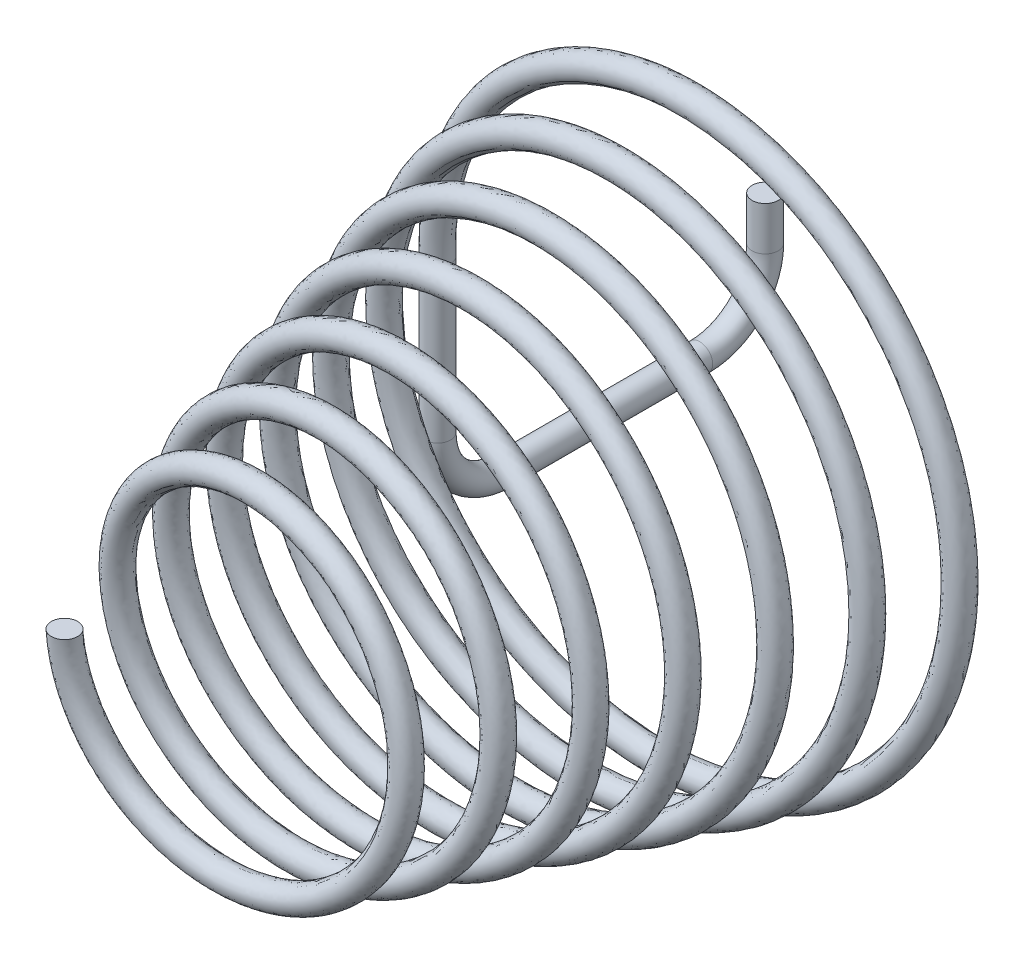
ISO-10303-21;
HEADER;
FILE_DESCRIPTION(('STEP AP214'),'2;1');
FILE_NAME('part.step','',(''),(''),'','','');
FILE_SCHEMA(('AUTOMOTIVE_DESIGN { 1 0 10303 214 1 1 1 1 }'));
ENDSEC;
DATA;
#1=APPLICATION_CONTEXT('core data for automotive mechanical design processes');
#2=APPLICATION_PROTOCOL_DEFINITION('international standard','automotive_design',2000,#1);
#3=PRODUCT_CONTEXT('',#1,'mechanical');
#4=PRODUCT('Part','Part','',(#3));
#5=PRODUCT_RELATED_PRODUCT_CATEGORY('part','',(#4));
#6=PRODUCT_DEFINITION_FORMATION('','',#4);
#7=PRODUCT_DEFINITION_CONTEXT('part definition',#1,'design');
#8=PRODUCT_DEFINITION('design','',#6,#7);
#9=PRODUCT_DEFINITION_SHAPE('','',#8);
#10=(LENGTH_UNIT() NAMED_UNIT(*) SI_UNIT(.MILLI.,.METRE.));
#11=(NAMED_UNIT(*) PLANE_ANGLE_UNIT() SI_UNIT($,.RADIAN.));
#12=(NAMED_UNIT(*) SI_UNIT($,.STERADIAN.) SOLID_ANGLE_UNIT());
#13=UNCERTAINTY_MEASURE_WITH_UNIT(LENGTH_MEASURE(1.E-05),#10,'distance_accuracy_value','');
#14=(GEOMETRIC_REPRESENTATION_CONTEXT(3) GLOBAL_UNCERTAINTY_ASSIGNED_CONTEXT((#13)) GLOBAL_UNIT_ASSIGNED_CONTEXT((#10,
#11,#12)) REPRESENTATION_CONTEXT('',''));
#15=CARTESIAN_POINT('',(0.,0.,0.));
#16=DIRECTION('',(0.,0.,1.));
#17=DIRECTION('',(1.,0.,0.));
#18=AXIS2_PLACEMENT_3D('',#15,#16,#17);
#19=CARTESIAN_POINT('',(-3.37392608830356,3.80822830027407E-13,11.6666666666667));
#20=DIRECTION('',(0.,1.,0.));
#21=DIRECTION('',(0.,0.,1.));
#22=AXIS2_PLACEMENT_3D('',#19,#20,#21);
#23=PLANE('',#22);
#24=CARTESIAN_POINT('',(-3.37392608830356,3.80822830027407E-13,11.6666666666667));
#25=DIRECTION('',(0.,1.,0.));
#26=DIRECTION('',(0.,0.,1.));
#27=AXIS2_PLACEMENT_3D('',#24,#25,#26);
#28=CIRCLE('',#27,0.3);
#29=CARTESIAN_POINT('',(-3.37392608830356,3.80822830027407E-13,11.9666666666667));
#30=VERTEX_POINT('',#29);
#31=EDGE_CURVE('E11',#30,#30,#28,.T.);
#32=ORIENTED_EDGE('',*,*,#31,.T.);
#33=EDGE_LOOP('',(#32));
#34=FACE_BOUND('',#33,.T.);
#35=ADVANCED_FACE('F27',(#34),#23,.T.);
#36=CARTESIAN_POINT('',(-6.5,0.,0.3));
#37=CARTESIAN_POINT('',(-6.48371811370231,1.48899107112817,0.360763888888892));
#38=CARTESIAN_POINT('',(-5.93689704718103,2.96055015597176,0.421527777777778));
#39=CARTESIAN_POINT('',(-4.0367236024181,5.22458877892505,0.543055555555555));
#40=CARTESIAN_POINT('',(-2.69062707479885,6.00914035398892,0.603819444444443));
#41=CARTESIAN_POINT('',(0.19256956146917,6.54944283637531,0.725347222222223));
#42=CARTESIAN_POINT('',(1.7191180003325,6.30369219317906,0.78611111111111));
#43=CARTESIAN_POINT('',(4.27088760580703,4.90282008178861,0.90763888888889));
#44=CARTESIAN_POINT('',(5.28707125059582,3.75319353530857,0.968402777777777));
#45=CARTESIAN_POINT('',(6.3623482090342,1.07215399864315,1.08993055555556));
#46=CARTESIAN_POINT('',(6.41797243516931,-0.449353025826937,1.15069444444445));
#47=CARTESIAN_POINT('',(5.55483533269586,-3.1825585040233,1.27222222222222));
#48=CARTESIAN_POINT('',(4.6396530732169,-4.38447647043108,1.33298611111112));
#49=CARTESIAN_POINT('',(2.25711865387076,-5.93727184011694,1.45451388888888));
#50=CARTESIAN_POINT('',(0.798670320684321,-6.28290446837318,1.51527777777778));
#51=CARTESIAN_POINT('',(-2.00586621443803,-5.97396113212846,1.63680555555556));
#52=CARTESIAN_POINT('',(-3.34182521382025,-5.32097147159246,1.69756944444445));
#53=CARTESIAN_POINT('',(-5.29794592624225,-3.31879966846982,1.81909722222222));
#54=CARTESIAN_POINT('',(-5.91134141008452,-1.97721224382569,1.87986111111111));
#55=CARTESIAN_POINT('',(-6.15108537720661,0.789166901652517,2.00138888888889));
#56=CARTESIAN_POINT('',(-5.77702949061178,2.20387617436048,2.06215277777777));
#57=CARTESIAN_POINT('',(-4.21981438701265,4.47580135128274,2.18368055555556));
#58=CARTESIAN_POINT('',(-3.04269371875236,5.32503439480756,2.24444444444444));
#59=CARTESIAN_POINT('',(-0.419070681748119,6.08687345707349,2.36597222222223));
#60=CARTESIAN_POINT('',(1.01777724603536,5.9971630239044,2.42673611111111));
#61=CARTESIAN_POINT('',(3.50849611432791,4.93022750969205,2.54826388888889));
#62=CARTESIAN_POINT('',(4.55350953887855,3.95730542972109,2.60902777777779));
#63=CARTESIAN_POINT('',(5.79145553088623,1.57219360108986,2.73055555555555));
#64=CARTESIAN_POINT('',(5.98030921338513,0.168877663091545,2.79131944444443));
#65=CARTESIAN_POINT('',(5.42852124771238,-2.43823513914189,2.91284722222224));
#66=CARTESIAN_POINT('',(4.69034022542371,-3.63266446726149,2.97361111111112));
#67=CARTESIAN_POINT('',(2.62716608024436,-5.28374276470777,3.09513888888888));
#68=CARTESIAN_POINT('',(1.30995498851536,-5.73476304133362,3.15590277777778));
#69=CARTESIAN_POINT('',(-1.30995498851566,-5.70220000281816,3.27743055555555));
#70=CARTESIAN_POINT('',(-2.60314866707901,-5.21920251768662,3.33819444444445));
#71=CARTESIAN_POINT('',(-4.59041012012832,-3.54617422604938,3.45972222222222));
#72=CARTESIAN_POINT('',(-5.27756467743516,-2.3625748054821,3.52048611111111));
#73=CARTESIAN_POINT('',(-5.74801487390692,0.169450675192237,3.64201388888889));
#74=CARTESIAN_POINT('',(-5.53006239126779,1.50859913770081,3.70277777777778));
#75=CARTESIAN_POINT('',(-4.29797435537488,3.74459594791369,3.82430555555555));
#76=CARTESIAN_POINT('',(-3.28872136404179,4.63355241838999,3.88506944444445));
#77=CARTESIAN_POINT('',(-0.938477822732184,5.57180918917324,4.00659722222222));
#78=CARTESIAN_POINT('',(0.393806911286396,5.61813752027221,4.06736111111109));
#79=CARTESIAN_POINT('',(2.78437894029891,4.85893713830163,4.18888888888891));
#80=CARTESIAN_POINT('',(3.83412884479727,4.05661040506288,4.24965277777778));
#81=CARTESIAN_POINT('',(5.18800173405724,1.97178451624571,4.37118055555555));
#82=CARTESIAN_POINT('',(5.48760164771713,0.69710908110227,4.43194444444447));
#83=CARTESIAN_POINT('',(5.21375344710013,-1.75110056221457,4.55347222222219));
#84=CARTESIAN_POINT('',(4.6417643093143,-2.91579834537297,4.61423611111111));
#85=CARTESIAN_POINT('',(2.89277280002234,-4.61873876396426,4.73576388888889));
#86=CARTESIAN_POINT('',(1.72244659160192,-5.15113372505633,4.79652777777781));
#87=CARTESIAN_POINT('',(-0.687605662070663,-5.35578255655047,4.91805555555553));
#88=CARTESIAN_POINT('',(-1.91854203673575,-5.02775938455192,4.97881944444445));
#89=CARTESIAN_POINT('',(-3.89275868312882,-3.66946676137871,5.10034722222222));
#90=CARTESIAN_POINT('',(-4.62913620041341,-2.64451415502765,5.16111111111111));
#91=CARTESIAN_POINT('',(-5.28703854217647,-0.363524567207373,5.28263888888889));
#92=CARTESIAN_POINT('',(-5.20662400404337,0.884101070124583,5.34340277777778));
#93=CARTESIAN_POINT('',(-4.27670867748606,3.04402394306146,5.46493055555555));
#94=CARTESIAN_POINT('',(-3.43101377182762,3.94866381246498,5.52569444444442));
#95=CARTESIAN_POINT('',(-1.36167473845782,5.01782572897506,5.64722222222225));
#96=CARTESIAN_POINT('',(-0.145758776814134,5.17888125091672,5.70798611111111));
#97=CARTESIAN_POINT('',(2.11018286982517,4.69694557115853,5.82951388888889));
#98=CARTESIAN_POINT('',(3.14211509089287,4.05616156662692,5.89027777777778));
#99=CARTESIAN_POINT('',(4.56604823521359,2.26976459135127,6.01180555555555));
#100=CARTESIAN_POINT('',(4.95324456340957,1.13092948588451,6.07256944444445));
#101=CARTESIAN_POINT('',(4.92068152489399,-1.13092948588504,6.19409722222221));
#102=CARTESIAN_POINT('',(4.50150798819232,-2.24574717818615,6.25486111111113));
#103=CARTESIAN_POINT('',(3.05562484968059,-3.95623146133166,6.37638888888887));
#104=CARTESIAN_POINT('',(2.03452253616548,-4.54598900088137,6.43715277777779));
#105=CARTESIAN_POINT('',(-0.146331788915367,-4.94658691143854,6.55868055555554));
#106=CARTESIAN_POINT('',(-1.29808027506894,-4.75643258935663,6.61944444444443));
#107=CARTESIAN_POINT('',(-3.21830429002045,-3.69312862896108,6.74097222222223));
#108=CARTESIAN_POINT('',(-3.98003358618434,-2.82424919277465,6.8017361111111));
#109=CARTESIAN_POINT('',(-4.78127016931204,-0.804801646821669,6.9232638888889));
#110=CARTESIAN_POINT('',(-4.81830260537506,0.338260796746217,6.98402777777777));
#111=CARTESIAN_POINT('',(-4.16303894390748,2.38619937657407,7.10555555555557));
#112=CARTESIAN_POINT('',(-3.47356773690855,3.28378121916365,7.16631944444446));
#113=CARTESIAN_POINT('',(-1.68645037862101,4.43873162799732,7.28784722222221));
#114=CARTESIAN_POINT('',(-0.595547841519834,4.69229882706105,7.34861111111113));
#115=CARTESIAN_POINT('',(1.49633490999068,4.45354576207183,7.47013888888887));
#116=CARTESIAN_POINT('',(2.4897714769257,3.96255714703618,7.53090277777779));
#117=CARTESIAN_POINT('',(3.93953160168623,2.46674593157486,7.65243055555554));
#118=CARTESIAN_POINT('',(4.39092604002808,1.46768093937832,7.71319444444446));
#119=CARTESIAN_POINT('',(4.56047973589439,-0.586044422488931,7.83472222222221));
#120=CARTESIAN_POINT('',(4.27848927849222,-1.63320789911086,7.89548611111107));
#121=CARTESIAN_POINT('',(3.11911913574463,-3.30971601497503,8.01701388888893));
#122=CARTESIAN_POINT('',(2.24633459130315,-3.93323800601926,8.07777777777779));
#123=CARTESIAN_POINT('',(0.307978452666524,-4.48720362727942,8.19930555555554));
#124=CARTESIAN_POINT('',(-0.750424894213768,-4.4160849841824,8.26006944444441));
#125=CARTESIAN_POINT('',(-2.57955177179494,-3.62318984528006,8.38159722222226));
#126=CARTESIAN_POINT('',(-3.34381808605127,-2.90472211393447,8.44236111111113));
#127=CARTESIAN_POINT('',(-4.24419592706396,-1.15115587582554,8.56388888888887));
#128=CARTESIAN_POINT('',(-4.37745328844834,-0.122639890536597,8.62465277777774));
#129=CARTESIAN_POINT('',(-3.96536989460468,1.78213060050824,8.74618055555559));
#130=CARTESIAN_POINT('',(-3.42198290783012,2.65156571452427,8.80694444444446));
#131=CARTESIAN_POINT('',(-1.91236310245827,3.84835370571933,8.92847222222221));
#132=CARTESIAN_POINT('',(-0.951903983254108,4.17172608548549,8.98923611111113));
#133=CARTESIAN_POINT('',(0.951903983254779,4.13916304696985,9.11076388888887));
#134=CARTESIAN_POINT('',(1.88834568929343,3.78381345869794,9.17152777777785));
#135=CARTESIAN_POINT('',(3.32205280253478,2.56507547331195,9.29305555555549));
#136=CARTESIAN_POINT('',(3.81441332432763,1.70647026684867,9.35381944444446));
#137=CARTESIAN_POINT('',(4.1451589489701,-0.123212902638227,9.47534722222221));
#138=CARTESIAN_POINT('',(3.98280278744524,-1.08756141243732,9.53611111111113));
#139=CARTESIAN_POINT('',(3.08828290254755,-2.69201263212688,9.65763888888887));
#140=CARTESIAN_POINT('',(2.35977702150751,-3.32651475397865,9.71840277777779));
#141=CARTESIAN_POINT('',(0.671125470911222,-3.99073114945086,9.83993055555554));
#142=CARTESIAN_POINT('',(-0.282714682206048,-4.01846769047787,9.90069444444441));
#143=CARTESIAN_POINT('',(-1.98801981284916,-3.4671407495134,10.0222222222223));
#144=CARTESIAN_POINT('',(-2.73343359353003,-2.89052506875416,10.0829861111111));
#145=CARTESIAN_POINT('',(-3.68946152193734,-1.40111624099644,10.2045138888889));
#146=CARTESIAN_POINT('',(-3.89699600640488,-0.493986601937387,10.2652777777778));
#147=CARTESIAN_POINT('',(-3.69333807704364,1.2415692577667,10.3868055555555));
#148=CARTESIAN_POINT('',(-3.2833499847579,2.06374460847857,10.4475694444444));
#149=CARTESIAN_POINT('',(-2.0407190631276,3.26032443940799,10.5690972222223));
#150=CARTESIAN_POINT('',(-1.21291528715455,3.63071835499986,10.6298611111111));
#151=CARTESIAN_POINT('',(0.484483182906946,3.76517691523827,10.7513888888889));
#152=CARTESIAN_POINT('',(1.3478737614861,3.52921917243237,10.8121527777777));
#153=CARTESIAN_POINT('',(2.72667334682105,2.56877151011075,10.9336805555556));
#154=CARTESIAN_POINT('',(3.2373398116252,1.84815502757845,10.9944444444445));
#155=CARTESIAN_POINT('',(3.68736871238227,0.252432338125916,11.1159722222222));
#156=CARTESIAN_POINT('',(3.62554596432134,-0.616748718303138,11.1767361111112));
#157=CARTESIAN_POINT('',(2.96967101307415,-2.11507960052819,11.2982638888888));
#158=CARTESIAN_POINT('',(2.37843045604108,-2.73897235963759,11.3590277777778));
#159=CARTESIAN_POINT('',(0.940637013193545,-3.47056612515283,11.4805555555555));
#160=CARTESIAN_POINT('',(0.0995210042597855,-3.57602532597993,11.5413194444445));
#161=CARTESIAN_POINT('',(-1.45407833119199,-3.23379421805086,11.6628472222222));
#162=CARTESIAN_POINT('',(-2.16101633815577,-2.78780424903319,11.7236111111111));
#163=CARTESIAN_POINT('',(-3.13065917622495,-1.55496161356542,11.8451388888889));
#164=CARTESIAN_POINT('',(-3.39020794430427,-0.772883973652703,11.9059027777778));
#165=CARTESIAN_POINT('',(-3.37392608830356,3.80822830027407E-13,11.9666666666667));
#166=CARTESIAN_POINT('',(-5.9,0.,0.3));
#167=CARTESIAN_POINT('',(-5.88371811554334,1.35154574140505,0.360763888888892));
#168=CARTESIAN_POINT('',(-5.38589700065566,2.68616010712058,0.421527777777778));
#169=CARTESIAN_POINT('',(-3.66011110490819,4.73770688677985,0.543055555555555));
#170=CARTESIAN_POINT('',(-2.43876948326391,5.44748324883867,0.603819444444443));
#171=CARTESIAN_POINT('',(0.174820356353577,5.93415760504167,0.725347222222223));
#172=CARTESIAN_POINT('',(1.55749505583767,5.70974861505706,0.78611111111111));
#173=CARTESIAN_POINT('',(3.86683446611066,4.43845814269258,0.90763888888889));
#174=CARTESIAN_POINT('',(4.78534120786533,3.39660145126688,0.968402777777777));
#175=CARTESIAN_POINT('',(5.75542281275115,0.96952596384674,1.08993055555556));
#176=CARTESIAN_POINT('',(5.80391024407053,-0.406708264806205,1.15069444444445));
#177=CARTESIAN_POINT('',(5.02056912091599,-2.87686165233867,1.27222222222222));
#178=CARTESIAN_POINT('',(4.19203013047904,-3.96195469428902,1.33298611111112));
#179=CARTESIAN_POINT('',(2.03805731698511,-5.36203008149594,1.45451388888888));
#180=CARTESIAN_POINT('',(0.720698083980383,-5.67232172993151,1.51527777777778));
#181=CARTESIAN_POINT('',(-1.8102734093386,-5.39032219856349,1.63680555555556));
#182=CARTESIAN_POINT('',(-3.01474897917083,-4.799519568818,1.69756944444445));
#183=CARTESIAN_POINT('',(-4.77649402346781,-2.99172343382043,1.81909722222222));
#184=CARTESIAN_POINT('',(-5.32770247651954,-1.78161943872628,1.87986111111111));
#185=CARTESIAN_POINT('',(-5.54050263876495,0.71119466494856,2.00138888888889));
#186=CARTESIAN_POINT('',(-5.20178773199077,1.98481483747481,2.06215277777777));
#187=CARTESIAN_POINT('',(-3.79729261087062,4.02817840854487,2.18368055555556));
#188=CARTESIAN_POINT('',(-2.73699686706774,4.79076818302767,2.24444444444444));
#189=CARTESIAN_POINT('',(-0.376425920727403,5.47281126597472,2.36597222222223));
#190=CARTESIAN_POINT('',(0.915149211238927,5.39023762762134,2.42673611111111));
#191=CARTESIAN_POINT('',(3.15190403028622,4.42849746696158,2.54826388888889));
#192=CARTESIAN_POINT('',(4.08914759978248,3.55325229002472,2.60902777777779));
#193=CARTESIAN_POINT('',(5.19751195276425,1.41057065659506,2.73055555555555));
#194=CARTESIAN_POINT('',(5.36502398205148,0.151128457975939,2.79131944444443));
#195=CARTESIAN_POINT('',(4.86686414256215,-2.1863775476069,2.91284722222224));
#196=CARTESIAN_POINT('',(4.20345833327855,-3.25605196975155,2.97361111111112));
#197=CARTESIAN_POINT('',(2.35277603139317,-4.7327427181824,3.09513888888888));
#198=CARTESIAN_POINT('',(1.1725106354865,-5.13476304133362,3.15590277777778));
#199=CARTESIAN_POINT('',(-1.17251063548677,-5.10220000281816,3.27743055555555));
#200=CARTESIAN_POINT('',(-2.32875861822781,-4.66820247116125,3.33819444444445));
#201=CARTESIAN_POINT('',(-4.10352822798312,-3.16956172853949,3.45972222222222));
#202=CARTESIAN_POINT('',(-4.71590757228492,-2.11071721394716,3.52048611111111));
#203=CARTESIAN_POINT('',(-5.13272964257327,0.15170147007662,3.64201388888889));
#204=CARTESIAN_POINT('',(-4.93611881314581,1.34697619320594,3.70277777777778));
#205=CARTESIAN_POINT('',(-3.83361241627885,3.34054280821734,3.82430555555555));
#206=CARTESIAN_POINT('',(-2.93212928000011,4.13182237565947,3.88506944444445));
#207=CARTESIAN_POINT('',(-0.835849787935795,4.9648837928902,4.00659722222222));
#208=CARTESIAN_POINT('',(0.351162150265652,5.00407532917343,4.06736111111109));
#209=CARTESIAN_POINT('',(2.47868208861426,4.32467092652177,4.18888888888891));
#210=CARTESIAN_POINT('',(3.41160706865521,3.60898746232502,4.24965277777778));
#211=CARTESIAN_POINT('',(4.61275997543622,1.75272317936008,4.37118055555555));
#212=CARTESIAN_POINT('',(4.87701890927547,0.619136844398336,4.43194444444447));
#213=CARTESIAN_POINT('',(4.63011451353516,-1.55550775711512,4.55347222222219));
#214=CARTESIAN_POINT('',(4.12031240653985,-2.58872211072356,4.61423611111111));
#215=CARTESIAN_POINT('',(2.56569656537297,-4.09728686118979,4.73576388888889));
#216=CARTESIAN_POINT('',(1.52685378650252,-4.56749479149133,4.79652777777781));
#217=CARTESIAN_POINT('',(-0.609633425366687,-4.74519981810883,4.91805555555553));
#218=CARTESIAN_POINT('',(-1.69948069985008,-4.45251762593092,4.97881944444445));
#219=CARTESIAN_POINT('',(-3.44513574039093,-3.24694498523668,5.10034722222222));
#220=CARTESIAN_POINT('',(-4.0948699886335,-2.33881730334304,5.16111111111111));
#221=CARTESIAN_POINT('',(-4.67297635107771,-0.320879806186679,5.28263888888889));
#222=CARTESIAN_POINT('',(-4.59969860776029,0.781473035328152,5.34340277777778));
#223=CARTESIAN_POINT('',(-3.77497863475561,2.68743185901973,5.46493055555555));
#224=CARTESIAN_POINT('',(-3.02696063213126,3.48430187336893,5.52569444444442));
#225=CARTESIAN_POINT('',(-1.20005179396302,4.42388215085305,5.64722222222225));
#226=CARTESIAN_POINT('',(-0.128009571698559,4.56359601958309,5.70798611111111));
#227=CARTESIAN_POINT('',(1.85832527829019,4.1352884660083,5.82951388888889));
#228=CARTESIAN_POINT('',(2.76550259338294,3.56927967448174,5.89027777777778));
#229=CARTESIAN_POINT('',(4.01504818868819,1.99537454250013,6.01180555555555));
#230=CARTESIAN_POINT('',(4.35324456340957,0.993485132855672,6.07256944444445));
#231=CARTESIAN_POINT('',(4.32068152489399,-0.993485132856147,6.19409722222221));
#232=CARTESIAN_POINT('',(3.95050794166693,-1.97135712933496,6.25486111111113));
#233=CARTESIAN_POINT('',(2.67901235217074,-3.46934956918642,6.37638888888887));
#234=CARTESIAN_POINT('',(1.78266494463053,-3.98433189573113,6.43715277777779));
#235=CARTESIAN_POINT('',(-0.128582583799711,-4.33130168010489,6.55868055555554));
#236=CARTESIAN_POINT('',(-1.13645733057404,-4.16248901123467,6.61944444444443));
#237=CARTESIAN_POINT('',(-2.81425115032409,-3.22876668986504,6.74097222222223));
#238=CARTESIAN_POINT('',(-3.47830354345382,-2.46765710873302,6.8017361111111));
#239=CARTESIAN_POINT('',(-4.17434477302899,-0.702173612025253,6.9232638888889));
#240=CARTESIAN_POINT('',(-4.20424041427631,0.295616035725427,6.98402777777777));
#241=CARTESIAN_POINT('',(-3.6287727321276,2.08050252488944,7.10555555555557));
#242=CARTESIAN_POINT('',(-3.02594479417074,2.86125944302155,7.16631944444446));
#243=CARTESIAN_POINT('',(-1.46738904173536,3.86348986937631,7.28784722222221));
#244=CARTESIAN_POINT('',(-0.517575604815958,4.0817160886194,7.34861111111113));
#245=CARTESIAN_POINT('',(1.30074210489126,3.86990682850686,7.47013888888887));
#246=CARTESIAN_POINT('',(2.16269524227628,3.44110524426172,7.53090277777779));
#247=CARTESIAN_POINT('',(3.41807969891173,2.13966969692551,7.65243055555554));
#248=CARTESIAN_POINT('',(3.8072871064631,1.27208813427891,7.71319444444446));
#249=CARTESIAN_POINT('',(3.94989699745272,-0.508072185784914,7.83472222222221));
#250=CARTESIAN_POINT('',(3.70324751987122,-1.41414656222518,7.89548611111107));
#251=CARTESIAN_POINT('',(2.69659735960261,-2.86209307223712,8.01701388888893));
#252=CARTESIAN_POINT('',(1.94063773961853,-3.39897179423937,8.07777777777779));
#253=CARTESIAN_POINT('',(0.265333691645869,-3.87314143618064,8.19930555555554));
#254=CARTESIAN_POINT('',(-0.647796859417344,-3.80915958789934,8.26006944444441));
#255=CARTESIAN_POINT('',(-2.22295968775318,-3.1214598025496,8.38159722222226));
#256=CARTESIAN_POINT('',(-2.87945614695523,-2.50066897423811,8.44236111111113));
#257=CARTESIAN_POINT('',(-3.65025234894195,-0.989532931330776,8.56388888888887));
#258=CARTESIAN_POINT('',(-3.76216805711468,-0.104890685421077,8.62465277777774));
#259=CARTESIAN_POINT('',(-3.40371278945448,1.53027300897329,8.74618055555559));
#260=CARTESIAN_POINT('',(-2.93510101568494,2.27495321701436,8.80694444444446));
#261=CARTESIAN_POINT('',(-1.63797305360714,3.29735365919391,8.92847222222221));
#262=CARTESIAN_POINT('',(-0.81445963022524,3.57172608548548,8.98923611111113));
#263=CARTESIAN_POINT('',(0.814459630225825,3.53916304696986,9.11076388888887));
#264=CARTESIAN_POINT('',(1.61395564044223,3.23281341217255,9.17152777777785));
#265=CARTESIAN_POINT('',(2.83517091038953,2.1884629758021,9.29305555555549));
#266=CARTESIAN_POINT('',(3.25275621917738,1.45461267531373,9.35381944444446));
#267=CARTESIAN_POINT('',(3.52987371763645,-0.105463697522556,9.47534722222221));
#268=CARTESIAN_POINT('',(3.3888592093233,-0.925938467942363,9.53611111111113));
#269=CARTESIAN_POINT('',(2.6239209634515,-2.28795949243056,9.65763888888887));
#270=CARTESIAN_POINT('',(2.00318493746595,-2.82478471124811,9.71840277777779));
#271=CARTESIAN_POINT('',(0.568497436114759,-3.38380575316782,9.83993055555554));
#272=CARTESIAN_POINT('',(-0.240069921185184,-3.40440549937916,9.90069444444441));
#273=CARTESIAN_POINT('',(-1.68232296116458,-2.93287453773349,10.0222222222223));
#274=CARTESIAN_POINT('',(-2.31091181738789,-2.44290212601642,10.0829861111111));
#275=CARTESIAN_POINT('',(-3.11421976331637,-1.18205490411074,10.2045138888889));
#276=CARTESIAN_POINT('',(-3.28641326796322,-0.416014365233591,10.2652777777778));
#277=CARTESIAN_POINT('',(-3.10969914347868,1.04597645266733,10.3868055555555));
#278=CARTESIAN_POINT('',(-2.76189808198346,1.73666837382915,10.4475694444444));
#279=CARTESIAN_POINT('',(-1.71364282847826,2.73887253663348,10.5690972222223));
#280=CARTESIAN_POINT('',(-1.01732248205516,3.04707942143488,10.6298611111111));
#281=CARTESIAN_POINT('',(0.406510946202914,3.1545941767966,10.7513888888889));
#282=CARTESIAN_POINT('',(1.12881242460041,2.95397741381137,10.8121527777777));
#283=CARTESIAN_POINT('',(2.27905040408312,2.14624973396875,10.9336805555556));
#284=CARTESIAN_POINT('',(2.70307359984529,1.54245817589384,10.9944444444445));
#285=CARTESIAN_POINT('',(3.0733065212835,0.209787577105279,11.1159722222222));
#286=CARTESIAN_POINT('',(3.01862056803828,-0.514120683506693,11.1767361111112));
#287=CARTESIAN_POINT('',(2.46794097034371,-1.75848751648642,11.2982638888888));
#288=CARTESIAN_POINT('',(1.97437731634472,-2.27461042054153,11.3590277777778));
#289=CARTESIAN_POINT('',(0.779014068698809,-2.87662254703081,11.4805555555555));
#290=CARTESIAN_POINT('',(0.0817717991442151,-2.96074009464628,11.5413194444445));
#291=CARTESIAN_POINT('',(-1.20222073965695,-2.67213711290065,11.6628472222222));
#292=CARTESIAN_POINT('',(-1.78440384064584,-2.30092235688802,11.7236111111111));
#293=CARTESIAN_POINT('',(-2.57965912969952,-1.28057156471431,11.8451388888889));
#294=CARTESIAN_POINT('',(-2.79020794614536,-0.635438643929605,11.9059027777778));
#295=CARTESIAN_POINT('',(-2.77392608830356,3.22165909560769E-13,11.9666666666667));
#296=CARTESIAN_POINT('',(-5.9,0.,-0.3));
#297=CARTESIAN_POINT('',(-5.8837181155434,1.35154574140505,-0.239236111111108));
#298=CARTESIAN_POINT('',(-5.38589700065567,2.68616010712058,-0.178472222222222));
#299=CARTESIAN_POINT('',(-3.66011110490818,4.73770688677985,-0.0569444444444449));
#300=CARTESIAN_POINT('',(-2.43876948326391,5.44748324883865,0.00381944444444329));
#301=CARTESIAN_POINT('',(0.174820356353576,5.9341576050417,0.125347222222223));
#302=CARTESIAN_POINT('',(1.55749505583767,5.70974861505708,0.18611111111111));
#303=CARTESIAN_POINT('',(3.86683446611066,4.43845814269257,0.30763888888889));
#304=CARTESIAN_POINT('',(4.78534120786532,3.39660145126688,0.368402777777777));
#305=CARTESIAN_POINT('',(5.75542281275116,0.96952596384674,0.489930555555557));
#306=CARTESIAN_POINT('',(5.80391024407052,-0.406708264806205,0.550694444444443));
#307=CARTESIAN_POINT('',(5.020569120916,-2.87686165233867,0.672222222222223));
#308=CARTESIAN_POINT('',(4.19203013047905,-3.961954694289,0.732986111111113));
#309=CARTESIAN_POINT('',(2.0380573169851,-5.36203008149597,0.854513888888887));
#310=CARTESIAN_POINT('',(0.72069808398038,-5.6723217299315,0.915277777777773));
#311=CARTESIAN_POINT('',(-1.8102734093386,-5.39032219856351,1.03680555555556));
#312=CARTESIAN_POINT('',(-3.01474897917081,-4.799519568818,1.09756944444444));
#313=CARTESIAN_POINT('',(-4.77649402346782,-2.99172343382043,1.21909722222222));
#314=CARTESIAN_POINT('',(-5.32770247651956,-1.78161943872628,1.27986111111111));
#315=CARTESIAN_POINT('',(-5.54050263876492,0.711194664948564,1.40138888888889));
#316=CARTESIAN_POINT('',(-5.20178773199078,1.98481483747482,1.46215277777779));
#317=CARTESIAN_POINT('',(-3.79729261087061,4.02817840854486,1.58368055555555));
#318=CARTESIAN_POINT('',(-2.73699686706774,4.79076818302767,1.64444444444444));
#319=CARTESIAN_POINT('',(-0.376425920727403,5.47281126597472,1.76597222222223));
#320=CARTESIAN_POINT('',(0.915149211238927,5.39023762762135,1.82673611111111));
#321=CARTESIAN_POINT('',(3.15190403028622,4.42849746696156,1.94826388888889));
#322=CARTESIAN_POINT('',(4.08914759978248,3.55325229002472,2.00902777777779));
#323=CARTESIAN_POINT('',(5.19751195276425,1.41057065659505,2.13055555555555));
#324=CARTESIAN_POINT('',(5.36502398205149,0.151128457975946,2.19131944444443));
#325=CARTESIAN_POINT('',(4.86686414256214,-2.18637754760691,2.31284722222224));
#326=CARTESIAN_POINT('',(4.20345833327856,-3.25605196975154,2.37361111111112));
#327=CARTESIAN_POINT('',(2.35277603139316,-4.73274271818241,2.49513888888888));
#328=CARTESIAN_POINT('',(1.1725106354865,-5.13476304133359,2.55590277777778));
#329=CARTESIAN_POINT('',(-1.17251063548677,-5.10220000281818,2.67743055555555));
#330=CARTESIAN_POINT('',(-2.3287586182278,-4.66820247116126,2.73819444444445));
#331=CARTESIAN_POINT('',(-4.10352822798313,-3.16956172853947,2.85972222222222));
#332=CARTESIAN_POINT('',(-4.7159075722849,-2.11071721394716,2.92048611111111));
#333=CARTESIAN_POINT('',(-5.13272964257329,0.151701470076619,3.04201388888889));
#334=CARTESIAN_POINT('',(-4.93611881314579,1.34697619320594,3.10277777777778));
#335=CARTESIAN_POINT('',(-3.83361241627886,3.34054280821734,3.22430555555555));
#336=CARTESIAN_POINT('',(-2.9321292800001,4.13182237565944,3.28506944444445));
#337=CARTESIAN_POINT('',(-0.835849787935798,4.96488379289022,3.40659722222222));
#338=CARTESIAN_POINT('',(0.351162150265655,5.00407532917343,3.4673611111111));
#339=CARTESIAN_POINT('',(2.47868208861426,4.32467092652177,3.5888888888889));
#340=CARTESIAN_POINT('',(3.41160706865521,3.60898746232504,3.64965277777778));
#341=CARTESIAN_POINT('',(4.61275997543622,1.75272317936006,3.77118055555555));
#342=CARTESIAN_POINT('',(4.87701890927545,0.619136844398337,3.83194444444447));
#343=CARTESIAN_POINT('',(4.63011451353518,-1.55550775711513,3.95347222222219));
#344=CARTESIAN_POINT('',(4.12031240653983,-2.58872211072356,4.01423611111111));
#345=CARTESIAN_POINT('',(2.56569656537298,-4.09728686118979,4.13576388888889));
#346=CARTESIAN_POINT('',(1.52685378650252,-4.56749479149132,4.19652777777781));
#347=CARTESIAN_POINT('',(-0.609633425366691,-4.74519981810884,4.31805555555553));
#348=CARTESIAN_POINT('',(-1.69948069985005,-4.45251762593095,4.37881944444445));
#349=CARTESIAN_POINT('',(-3.44513574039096,-3.24694498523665,4.50034722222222));
#350=CARTESIAN_POINT('',(-4.09486998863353,-2.33881730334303,4.56111111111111));
#351=CARTESIAN_POINT('',(-4.67297635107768,-0.320879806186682,4.68263888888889));
#352=CARTESIAN_POINT('',(-4.59969860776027,0.781473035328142,4.74340277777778));
#353=CARTESIAN_POINT('',(-3.77497863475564,2.68743185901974,4.86493055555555));
#354=CARTESIAN_POINT('',(-3.02696063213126,3.48430187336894,4.92569444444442));
#355=CARTESIAN_POINT('',(-1.20005179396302,4.42388215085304,5.04722222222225));
#356=CARTESIAN_POINT('',(-0.12800957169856,4.56359601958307,5.10798611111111));
#357=CARTESIAN_POINT('',(1.85832527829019,4.13528846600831,5.22951388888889));
#358=CARTESIAN_POINT('',(2.76550259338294,3.56927967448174,5.29027777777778));
#359=CARTESIAN_POINT('',(4.0150481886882,1.99537454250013,5.41180555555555));
#360=CARTESIAN_POINT('',(4.35324456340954,0.993485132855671,5.47256944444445));
#361=CARTESIAN_POINT('',(4.32068152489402,-0.993485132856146,5.59409722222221));
#362=CARTESIAN_POINT('',(3.95050794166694,-1.97135712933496,5.65486111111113));
#363=CARTESIAN_POINT('',(2.67901235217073,-3.46934956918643,5.77638888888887));
#364=CARTESIAN_POINT('',(1.78266494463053,-3.98433189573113,5.83715277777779));
#365=CARTESIAN_POINT('',(-0.128582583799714,-4.33130168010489,5.95868055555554));
#366=CARTESIAN_POINT('',(-1.13645733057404,-4.16248901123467,6.01944444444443));
#367=CARTESIAN_POINT('',(-2.8142511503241,-3.22876668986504,6.14097222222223));
#368=CARTESIAN_POINT('',(-3.47830354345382,-2.46765710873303,6.2017361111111));
#369=CARTESIAN_POINT('',(-4.17434477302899,-0.702173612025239,6.3232638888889));
#370=CARTESIAN_POINT('',(-4.20424041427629,0.295616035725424,6.38402777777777));
#371=CARTESIAN_POINT('',(-3.62877273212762,2.08050252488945,6.50555555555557));
#372=CARTESIAN_POINT('',(-3.02594479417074,2.86125944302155,6.56631944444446));
#373=CARTESIAN_POINT('',(-1.46738904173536,3.86348986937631,6.68784722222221));
#374=CARTESIAN_POINT('',(-0.517575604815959,4.08171608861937,6.74861111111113));
#375=CARTESIAN_POINT('',(1.30074210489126,3.86990682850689,6.87013888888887));
#376=CARTESIAN_POINT('',(2.16269524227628,3.44110524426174,6.93090277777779));
#377=CARTESIAN_POINT('',(3.41807969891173,2.1396696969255,7.05243055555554));
#378=CARTESIAN_POINT('',(3.80728710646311,1.27208813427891,7.11319444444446));
#379=CARTESIAN_POINT('',(3.94989699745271,-0.508072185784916,7.23472222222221));
#380=CARTESIAN_POINT('',(3.70324751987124,-1.41414656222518,7.2954861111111));
#381=CARTESIAN_POINT('',(2.6965973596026,-2.86209307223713,7.4170138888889));
#382=CARTESIAN_POINT('',(1.94063773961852,-3.39897179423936,7.47777777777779));
#383=CARTESIAN_POINT('',(0.265333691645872,-3.87314143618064,7.59930555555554));
#384=CARTESIAN_POINT('',(-0.647796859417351,-3.80915958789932,7.66006944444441));
#385=CARTESIAN_POINT('',(-2.22295968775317,-3.12145980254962,7.78159722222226));
#386=CARTESIAN_POINT('',(-2.87945614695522,-2.5006689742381,7.84236111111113));
#387=CARTESIAN_POINT('',(-3.65025234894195,-0.989532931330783,7.96388888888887));
#388=CARTESIAN_POINT('',(-3.76216805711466,-0.104890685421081,8.02465277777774));
#389=CARTESIAN_POINT('',(-3.4037127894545,1.53027300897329,8.14618055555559));
#390=CARTESIAN_POINT('',(-2.93510101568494,2.27495321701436,8.20694444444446));
#391=CARTESIAN_POINT('',(-1.63797305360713,3.29735365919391,8.32847222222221));
#392=CARTESIAN_POINT('',(-0.81445963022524,3.57172608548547,8.38923611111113));
#393=CARTESIAN_POINT('',(0.814459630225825,3.53916304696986,8.51076388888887));
#394=CARTESIAN_POINT('',(1.61395564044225,3.23281341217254,8.57152777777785));
#395=CARTESIAN_POINT('',(2.83517091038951,2.18846297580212,8.69305555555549));
#396=CARTESIAN_POINT('',(3.25275621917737,1.45461267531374,8.75381944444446));
#397=CARTESIAN_POINT('',(3.52987371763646,-0.10546369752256,8.87534722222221));
#398=CARTESIAN_POINT('',(3.38885920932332,-0.925938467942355,8.93611111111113));
#399=CARTESIAN_POINT('',(2.62392096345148,-2.28795949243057,9.05763888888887));
#400=CARTESIAN_POINT('',(2.00318493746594,-2.82478471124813,9.11840277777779));
#401=CARTESIAN_POINT('',(0.568497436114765,-3.3838057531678,9.23993055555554));
#402=CARTESIAN_POINT('',(-0.240069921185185,-3.40440549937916,9.30069444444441));
#403=CARTESIAN_POINT('',(-1.68232296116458,-2.93287453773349,9.42222222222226));
#404=CARTESIAN_POINT('',(-2.3109118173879,-2.44290212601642,9.48298611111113));
#405=CARTESIAN_POINT('',(-3.11421976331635,-1.18205490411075,9.60451388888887));
#406=CARTESIAN_POINT('',(-3.28641326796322,-0.41601436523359,9.66527777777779));
#407=CARTESIAN_POINT('',(-3.10969914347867,1.04597645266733,9.78680555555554));
#408=CARTESIAN_POINT('',(-2.76189808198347,1.73666837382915,9.84756944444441));
#409=CARTESIAN_POINT('',(-1.71364282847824,2.73887253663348,9.96909722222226));
#410=CARTESIAN_POINT('',(-1.01732248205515,3.04707942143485,10.0298611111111));
#411=CARTESIAN_POINT('',(0.406510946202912,3.15459417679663,10.1513888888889));
#412=CARTESIAN_POINT('',(1.12881242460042,2.95397741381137,10.2121527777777));
#413=CARTESIAN_POINT('',(2.27905040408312,2.14624973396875,10.3336805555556));
#414=CARTESIAN_POINT('',(2.70307359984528,1.54245817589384,10.3944444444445));
#415=CARTESIAN_POINT('',(3.0733065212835,0.209787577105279,10.5159722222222));
#416=CARTESIAN_POINT('',(3.01862056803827,-0.514120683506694,10.5767361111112));
#417=CARTESIAN_POINT('',(2.46794097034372,-1.75848751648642,10.6982638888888));
#418=CARTESIAN_POINT('',(1.97437731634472,-2.27461042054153,10.7590277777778));
#419=CARTESIAN_POINT('',(0.779014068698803,-2.87662254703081,10.8805555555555));
#420=CARTESIAN_POINT('',(0.081771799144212,-2.9607400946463,10.9413194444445));
#421=CARTESIAN_POINT('',(-1.20222073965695,-2.67213711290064,11.0628472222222));
#422=CARTESIAN_POINT('',(-1.78440384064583,-2.30092235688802,11.1236111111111));
#423=CARTESIAN_POINT('',(-2.57965912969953,-1.28057156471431,11.2451388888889));
#424=CARTESIAN_POINT('',(-2.79020794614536,-0.635438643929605,11.3059027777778));
#425=CARTESIAN_POINT('',(-2.77392608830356,3.22165909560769E-13,11.3666666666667));
#426=CARTESIAN_POINT('',(-6.5,0.,-0.3));
#427=CARTESIAN_POINT('',(-6.48371811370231,1.48899107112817,-0.239236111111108));
#428=CARTESIAN_POINT('',(-5.93689704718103,2.96055015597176,-0.178472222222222));
#429=CARTESIAN_POINT('',(-4.0367236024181,5.22458877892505,-0.056944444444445));
#430=CARTESIAN_POINT('',(-2.69062707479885,6.00914035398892,0.00381944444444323));
#431=CARTESIAN_POINT('',(0.19256956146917,6.54944283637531,0.125347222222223));
#432=CARTESIAN_POINT('',(1.7191180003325,6.30369219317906,0.18611111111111));
#433=CARTESIAN_POINT('',(4.27088760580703,4.90282008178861,0.30763888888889));
#434=CARTESIAN_POINT('',(5.28707125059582,3.75319353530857,0.368402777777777));
#435=CARTESIAN_POINT('',(6.3623482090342,1.07215399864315,0.489930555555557));
#436=CARTESIAN_POINT('',(6.41797243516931,-0.449353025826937,0.550694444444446));
#437=CARTESIAN_POINT('',(5.55483533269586,-3.1825585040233,0.67222222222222));
#438=CARTESIAN_POINT('',(4.63965307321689,-4.38447647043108,0.732986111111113));
#439=CARTESIAN_POINT('',(2.25711865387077,-5.93727184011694,0.854513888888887));
#440=CARTESIAN_POINT('',(0.798670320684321,-6.28290446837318,0.915277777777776));
#441=CARTESIAN_POINT('',(-2.00586621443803,-5.97396113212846,1.03680555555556));
#442=CARTESIAN_POINT('',(-3.34182521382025,-5.32097147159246,1.09756944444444));
#443=CARTESIAN_POINT('',(-5.29794592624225,-3.31879966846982,1.21909722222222));
#444=CARTESIAN_POINT('',(-5.91134141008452,-1.97721224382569,1.27986111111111));
#445=CARTESIAN_POINT('',(-6.15108537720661,0.789166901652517,1.40138888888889));
#446=CARTESIAN_POINT('',(-5.77702949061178,2.20387617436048,1.46215277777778));
#447=CARTESIAN_POINT('',(-4.21981438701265,4.47580135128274,1.58368055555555));
#448=CARTESIAN_POINT('',(-3.04269371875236,5.32503439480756,1.64444444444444));
#449=CARTESIAN_POINT('',(-0.419070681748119,6.08687345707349,1.76597222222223));
#450=CARTESIAN_POINT('',(1.01777724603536,5.9971630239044,1.82673611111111));
#451=CARTESIAN_POINT('',(3.50849611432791,4.93022750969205,1.94826388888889));
#452=CARTESIAN_POINT('',(4.55350953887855,3.95730542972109,2.00902777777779));
#453=CARTESIAN_POINT('',(5.79145553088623,1.57219360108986,2.13055555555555));
#454=CARTESIAN_POINT('',(5.98030921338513,0.168877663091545,2.19131944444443));
#455=CARTESIAN_POINT('',(5.42852124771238,-2.43823513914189,2.31284722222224));
#456=CARTESIAN_POINT('',(4.69034022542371,-3.63266446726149,2.37361111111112));
#457=CARTESIAN_POINT('',(2.62716608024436,-5.28374276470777,2.49513888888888));
#458=CARTESIAN_POINT('',(1.30995498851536,-5.73476304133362,2.55590277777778));
#459=CARTESIAN_POINT('',(-1.30995498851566,-5.70220000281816,2.67743055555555));
#460=CARTESIAN_POINT('',(-2.60314866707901,-5.21920251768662,2.73819444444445));
#461=CARTESIAN_POINT('',(-4.59041012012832,-3.54617422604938,2.85972222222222));
#462=CARTESIAN_POINT('',(-5.27756467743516,-2.3625748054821,2.92048611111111));
#463=CARTESIAN_POINT('',(-5.74801487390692,0.169450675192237,3.04201388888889));
#464=CARTESIAN_POINT('',(-5.53006239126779,1.50859913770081,3.10277777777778));
#465=CARTESIAN_POINT('',(-4.29797435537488,3.74459594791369,3.22430555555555));
#466=CARTESIAN_POINT('',(-3.28872136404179,4.63355241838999,3.28506944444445));
#467=CARTESIAN_POINT('',(-0.938477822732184,5.57180918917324,3.40659722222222));
#468=CARTESIAN_POINT('',(0.393806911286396,5.61813752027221,3.4673611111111));
#469=CARTESIAN_POINT('',(2.78437894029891,4.85893713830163,3.5888888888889));
#470=CARTESIAN_POINT('',(3.83412884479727,4.05661040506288,3.64965277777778));
#471=CARTESIAN_POINT('',(5.18800173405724,1.97178451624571,3.77118055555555));
#472=CARTESIAN_POINT('',(5.48760164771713,0.69710908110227,3.83194444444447));
#473=CARTESIAN_POINT('',(5.21375344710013,-1.75110056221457,3.95347222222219));
#474=CARTESIAN_POINT('',(4.6417643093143,-2.91579834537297,4.01423611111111));
#475=CARTESIAN_POINT('',(2.89277280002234,-4.61873876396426,4.13576388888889));
#476=CARTESIAN_POINT('',(1.72244659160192,-5.15113372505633,4.19652777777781));
#477=CARTESIAN_POINT('',(-0.687605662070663,-5.35578255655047,4.31805555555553));
#478=CARTESIAN_POINT('',(-1.91854203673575,-5.02775938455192,4.37881944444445));
#479=CARTESIAN_POINT('',(-3.89275868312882,-3.66946676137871,4.50034722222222));
#480=CARTESIAN_POINT('',(-4.62913620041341,-2.64451415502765,4.56111111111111));
#481=CARTESIAN_POINT('',(-5.28703854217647,-0.363524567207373,4.68263888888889));
#482=CARTESIAN_POINT('',(-5.20662400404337,0.884101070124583,4.74340277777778));
#483=CARTESIAN_POINT('',(-4.27670867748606,3.04402394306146,4.86493055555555));
#484=CARTESIAN_POINT('',(-3.43101377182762,3.94866381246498,4.92569444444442));
#485=CARTESIAN_POINT('',(-1.36167473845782,5.01782572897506,5.04722222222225));
#486=CARTESIAN_POINT('',(-0.145758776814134,5.17888125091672,5.10798611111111));
#487=CARTESIAN_POINT('',(2.11018286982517,4.69694557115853,5.22951388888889));
#488=CARTESIAN_POINT('',(3.14211509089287,4.05616156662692,5.29027777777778));
#489=CARTESIAN_POINT('',(4.56604823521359,2.26976459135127,5.41180555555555));
#490=CARTESIAN_POINT('',(4.95324456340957,1.13092948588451,5.47256944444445));
#491=CARTESIAN_POINT('',(4.92068152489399,-1.13092948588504,5.59409722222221));
#492=CARTESIAN_POINT('',(4.50150798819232,-2.24574717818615,5.65486111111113));
#493=CARTESIAN_POINT('',(3.05562484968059,-3.95623146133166,5.77638888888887));
#494=CARTESIAN_POINT('',(2.03452253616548,-4.54598900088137,5.83715277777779));
#495=CARTESIAN_POINT('',(-0.146331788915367,-4.94658691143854,5.95868055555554));
#496=CARTESIAN_POINT('',(-1.29808027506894,-4.75643258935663,6.01944444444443));
#497=CARTESIAN_POINT('',(-3.21830429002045,-3.69312862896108,6.14097222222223));
#498=CARTESIAN_POINT('',(-3.98003358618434,-2.82424919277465,6.2017361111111));
#499=CARTESIAN_POINT('',(-4.78127016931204,-0.804801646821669,6.3232638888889));
#500=CARTESIAN_POINT('',(-4.81830260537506,0.338260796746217,6.38402777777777));
#501=CARTESIAN_POINT('',(-4.16303894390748,2.38619937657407,6.50555555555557));
#502=CARTESIAN_POINT('',(-3.47356773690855,3.28378121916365,6.56631944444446));
#503=CARTESIAN_POINT('',(-1.68645037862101,4.43873162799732,6.68784722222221));
#504=CARTESIAN_POINT('',(-0.595547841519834,4.69229882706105,6.74861111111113));
#505=CARTESIAN_POINT('',(1.49633490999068,4.45354576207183,6.87013888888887));
#506=CARTESIAN_POINT('',(2.4897714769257,3.96255714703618,6.93090277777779));
#507=CARTESIAN_POINT('',(3.93953160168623,2.46674593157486,7.05243055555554));
#508=CARTESIAN_POINT('',(4.39092604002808,1.46768093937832,7.11319444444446));
#509=CARTESIAN_POINT('',(4.56047973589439,-0.586044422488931,7.23472222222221));
#510=CARTESIAN_POINT('',(4.27848927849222,-1.63320789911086,7.2954861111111));
#511=CARTESIAN_POINT('',(3.11911913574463,-3.30971601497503,7.4170138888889));
#512=CARTESIAN_POINT('',(2.24633459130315,-3.93323800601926,7.47777777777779));
#513=CARTESIAN_POINT('',(0.307978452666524,-4.48720362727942,7.59930555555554));
#514=CARTESIAN_POINT('',(-0.750424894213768,-4.4160849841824,7.66006944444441));
#515=CARTESIAN_POINT('',(-2.57955177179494,-3.62318984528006,7.78159722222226));
#516=CARTESIAN_POINT('',(-3.34381808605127,-2.90472211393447,7.84236111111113));
#517=CARTESIAN_POINT('',(-4.24419592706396,-1.15115587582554,7.96388888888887));
#518=CARTESIAN_POINT('',(-4.37745328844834,-0.122639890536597,8.02465277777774));
#519=CARTESIAN_POINT('',(-3.96536989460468,1.78213060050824,8.14618055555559));
#520=CARTESIAN_POINT('',(-3.42198290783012,2.65156571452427,8.20694444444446));
#521=CARTESIAN_POINT('',(-1.91236310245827,3.84835370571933,8.32847222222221));
#522=CARTESIAN_POINT('',(-0.951903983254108,4.17172608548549,8.38923611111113));
#523=CARTESIAN_POINT('',(0.951903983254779,4.13916304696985,8.51076388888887));
#524=CARTESIAN_POINT('',(1.88834568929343,3.78381345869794,8.57152777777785));
#525=CARTESIAN_POINT('',(3.32205280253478,2.56507547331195,8.69305555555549));
#526=CARTESIAN_POINT('',(3.81441332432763,1.70647026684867,8.75381944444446));
#527=CARTESIAN_POINT('',(4.1451589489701,-0.123212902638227,8.87534722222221));
#528=CARTESIAN_POINT('',(3.98280278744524,-1.08756141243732,8.93611111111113));
#529=CARTESIAN_POINT('',(3.08828290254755,-2.69201263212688,9.05763888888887));
#530=CARTESIAN_POINT('',(2.35977702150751,-3.32651475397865,9.11840277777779));
#531=CARTESIAN_POINT('',(0.671125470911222,-3.99073114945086,9.23993055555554));
#532=CARTESIAN_POINT('',(-0.282714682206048,-4.01846769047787,9.30069444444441));
#533=CARTESIAN_POINT('',(-1.98801981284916,-3.4671407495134,9.42222222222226));
#534=CARTESIAN_POINT('',(-2.73343359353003,-2.89052506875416,9.48298611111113));
#535=CARTESIAN_POINT('',(-3.68946152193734,-1.40111624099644,9.60451388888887));
#536=CARTESIAN_POINT('',(-3.89699600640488,-0.493986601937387,9.66527777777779));
#537=CARTESIAN_POINT('',(-3.69333807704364,1.2415692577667,9.78680555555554));
#538=CARTESIAN_POINT('',(-3.2833499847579,2.06374460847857,9.84756944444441));
#539=CARTESIAN_POINT('',(-2.0407190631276,3.26032443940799,9.96909722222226));
#540=CARTESIAN_POINT('',(-1.21291528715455,3.63071835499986,10.0298611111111));
#541=CARTESIAN_POINT('',(0.484483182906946,3.76517691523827,10.1513888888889));
#542=CARTESIAN_POINT('',(1.3478737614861,3.52921917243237,10.2121527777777));
#543=CARTESIAN_POINT('',(2.72667334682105,2.56877151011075,10.3336805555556));
#544=CARTESIAN_POINT('',(3.2373398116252,1.84815502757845,10.3944444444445));
#545=CARTESIAN_POINT('',(3.68736871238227,0.252432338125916,10.5159722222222));
#546=CARTESIAN_POINT('',(3.62554596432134,-0.616748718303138,10.5767361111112));
#547=CARTESIAN_POINT('',(2.96967101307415,-2.11507960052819,10.6982638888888));
#548=CARTESIAN_POINT('',(2.37843045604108,-2.73897235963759,10.7590277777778));
#549=CARTESIAN_POINT('',(0.940637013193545,-3.47056612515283,10.8805555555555));
#550=CARTESIAN_POINT('',(0.0995210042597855,-3.57602532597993,10.9413194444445));
#551=CARTESIAN_POINT('',(-1.45407833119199,-3.23379421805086,11.0628472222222));
#552=CARTESIAN_POINT('',(-2.16101633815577,-2.78780424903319,11.1236111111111));
#553=CARTESIAN_POINT('',(-3.13065917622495,-1.55496161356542,11.2451388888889));
#554=CARTESIAN_POINT('',(-3.39020794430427,-0.772883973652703,11.3059027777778));
#555=CARTESIAN_POINT('',(-3.37392608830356,3.80822830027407E-13,11.3666666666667));
#556=CARTESIAN_POINT('',(-7.1,0.,-0.3));
#557=CARTESIAN_POINT('',(-7.08371811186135,1.6264364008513,-0.239236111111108));
#558=CARTESIAN_POINT('',(-6.48789709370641,3.23494020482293,-0.178472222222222));
#559=CARTESIAN_POINT('',(-4.413336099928,5.71147067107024,-0.0569444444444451));
#560=CARTESIAN_POINT('',(-2.9424846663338,6.57079745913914,0.00381944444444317));
#561=CARTESIAN_POINT('',(0.210318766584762,7.16472806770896,0.125347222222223));
#562=CARTESIAN_POINT('',(1.88074094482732,6.89763577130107,0.18611111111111));
#563=CARTESIAN_POINT('',(4.67494074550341,5.36718202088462,0.30763888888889));
#564=CARTESIAN_POINT('',(5.7888012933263,4.10978561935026,0.368402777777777));
#565=CARTESIAN_POINT('',(6.96927360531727,1.17478203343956,0.489930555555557));
#566=CARTESIAN_POINT('',(7.03203462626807,-0.491997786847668,0.550694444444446));
#567=CARTESIAN_POINT('',(6.08910154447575,-3.48825535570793,0.67222222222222));
#568=CARTESIAN_POINT('',(5.08727601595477,-4.80699824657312,0.732986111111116));
#569=CARTESIAN_POINT('',(2.47617999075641,-6.51251359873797,0.854513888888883));
#570=CARTESIAN_POINT('',(0.876642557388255,-6.89348720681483,0.915277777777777));
#571=CARTESIAN_POINT('',(-2.20145901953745,-6.55760006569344,1.03680555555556));
#572=CARTESIAN_POINT('',(-3.66890144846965,-5.84242337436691,1.09756944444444));
#573=CARTESIAN_POINT('',(-5.81939782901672,-3.64587590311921,1.21909722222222));
#574=CARTESIAN_POINT('',(-6.49498034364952,-2.17280504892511,1.27986111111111));
#575=CARTESIAN_POINT('',(-6.76166811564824,0.867139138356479,1.40138888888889));
#576=CARTESIAN_POINT('',(-6.35227124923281,2.42293751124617,1.46215277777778));
#577=CARTESIAN_POINT('',(-4.64233616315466,4.92342429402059,1.58368055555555));
#578=CARTESIAN_POINT('',(-3.34839057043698,5.85930060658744,1.64444444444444));
#579=CARTESIAN_POINT('',(-0.461715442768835,6.70093564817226,1.76597222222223));
#580=CARTESIAN_POINT('',(1.12040528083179,6.60408842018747,1.82673611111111));
#581=CARTESIAN_POINT('',(3.86508819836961,5.43195755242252,1.94826388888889));
#582=CARTESIAN_POINT('',(5.01787147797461,4.36135856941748,2.00902777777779));
#583=CARTESIAN_POINT('',(6.38539910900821,1.73381654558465,2.13055555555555));
#584=CARTESIAN_POINT('',(6.59559444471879,0.186626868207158,2.19131944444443));
#585=CARTESIAN_POINT('',(5.99017835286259,-2.69009273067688,2.31284722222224));
#586=CARTESIAN_POINT('',(5.17722211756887,-4.00927696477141,2.37361111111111));
#587=CARTESIAN_POINT('',(2.90155612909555,-5.83474281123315,2.49513888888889));
#588=CARTESIAN_POINT('',(1.44739934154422,-6.33476304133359,2.5559027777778));
#589=CARTESIAN_POINT('',(-1.44739934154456,-6.30220000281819,2.67743055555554));
#590=CARTESIAN_POINT('',(-2.87753871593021,-5.77020256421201,2.73819444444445));
#591=CARTESIAN_POINT('',(-5.07729201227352,-3.92278672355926,2.85972222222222));
#592=CARTESIAN_POINT('',(-5.83922178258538,-2.61443239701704,2.92048611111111));
#593=CARTESIAN_POINT('',(-6.36330010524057,0.187199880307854,3.04201388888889));
#594=CARTESIAN_POINT('',(-6.12400596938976,1.67022208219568,3.10277777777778));
#595=CARTESIAN_POINT('',(-4.76233629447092,4.14864908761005,3.22430555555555));
#596=CARTESIAN_POINT('',(-3.64531344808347,5.13528246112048,3.28506944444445));
#597=CARTESIAN_POINT('',(-1.04110585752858,6.1787345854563,3.40659722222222));
#598=CARTESIAN_POINT('',(0.436451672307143,6.23219971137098,3.46736111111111));
#599=CARTESIAN_POINT('',(3.09007579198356,5.3932033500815,3.58888888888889));
#600=CARTESIAN_POINT('',(4.25665062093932,4.50423334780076,3.64965277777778));
#601=CARTESIAN_POINT('',(5.76324349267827,2.19084585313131,3.77118055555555));
#602=CARTESIAN_POINT('',(6.09818438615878,0.775081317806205,3.83194444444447));
#603=CARTESIAN_POINT('',(5.79739238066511,-1.94669336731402,3.95347222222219));
#604=CARTESIAN_POINT('',(5.16321621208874,-3.24287458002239,4.01423611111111));
#605=CARTESIAN_POINT('',(3.21984903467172,-5.14019066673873,4.13576388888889));
#606=CARTESIAN_POINT('',(1.91803939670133,-5.73477265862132,4.19652777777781));
#607=CARTESIAN_POINT('',(-0.765577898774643,-5.96636529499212,4.31805555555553));
#608=CARTESIAN_POINT('',(-2.13760337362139,-5.60300114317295,4.37881944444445));
#609=CARTESIAN_POINT('',(-4.34038162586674,-4.09198853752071,4.50034722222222));
#610=CARTESIAN_POINT('',(-5.16340241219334,-2.95021100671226,4.56111111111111));
#611=CARTESIAN_POINT('',(-5.90110073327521,-0.40616932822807,4.68263888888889));
#612=CARTESIAN_POINT('',(-5.81354940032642,0.986729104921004,4.74340277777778));
#613=CARTESIAN_POINT('',(-4.77843872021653,3.40061602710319,4.86493055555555));
#614=CARTESIAN_POINT('',(-3.83506691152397,4.41302575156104,4.92569444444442));
#615=CARTESIAN_POINT('',(-1.52329768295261,5.61176930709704,5.04722222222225));
#616=CARTESIAN_POINT('',(-0.163507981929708,5.79416648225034,5.10798611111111));
#617=CARTESIAN_POINT('',(2.36204046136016,5.25860267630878,5.22951388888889));
#618=CARTESIAN_POINT('',(3.51872758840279,4.5430434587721,5.29027777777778));
#619=CARTESIAN_POINT('',(5.11704828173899,2.54415464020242,5.41180555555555));
#620=CARTESIAN_POINT('',(5.55324456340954,1.26837383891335,5.47256944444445));
#621=CARTESIAN_POINT('',(5.52068152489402,-1.26837383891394,5.59409722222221));
#622=CARTESIAN_POINT('',(5.05250803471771,-2.52013722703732,5.65486111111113));
#623=CARTESIAN_POINT('',(3.43223734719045,-4.4431133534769,5.77638888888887));
#624=CARTESIAN_POINT('',(2.28638012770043,-5.10764610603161,5.83715277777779));
#625=CARTESIAN_POINT('',(-0.164080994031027,-5.56187214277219,5.95868055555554));
#626=CARTESIAN_POINT('',(-1.45970321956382,-5.35037616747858,6.01944444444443));
#627=CARTESIAN_POINT('',(-3.62235742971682,-4.15749056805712,6.14097222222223));
#628=CARTESIAN_POINT('',(-4.48176362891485,-3.1808412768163,6.2017361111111));
#629=CARTESIAN_POINT('',(-5.38819556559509,-0.907429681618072,6.3232638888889));
#630=CARTESIAN_POINT('',(-5.43236479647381,0.380905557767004,6.38402777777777));
#631=CARTESIAN_POINT('',(-4.69730515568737,2.6918962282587,6.50555555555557));
#632=CARTESIAN_POINT('',(-3.92119067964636,3.70630299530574,6.56631944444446));
#633=CARTESIAN_POINT('',(-1.90551171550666,5.01397338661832,6.68784722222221));
#634=CARTESIAN_POINT('',(-0.673520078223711,5.30288156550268,6.74861111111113));
#635=CARTESIAN_POINT('',(1.69192771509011,5.03718469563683,6.87013888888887));
#636=CARTESIAN_POINT('',(2.81684771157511,4.48400904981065,6.93090277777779));
#637=CARTESIAN_POINT('',(4.46098350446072,2.7938221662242,7.05243055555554));
#638=CARTESIAN_POINT('',(4.97456497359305,1.66327374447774,7.11319444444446));
#639=CARTESIAN_POINT('',(5.17106247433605,-0.664016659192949,7.23472222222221));
#640=CARTESIAN_POINT('',(4.85373103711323,-1.85226923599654,7.2954861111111));
#641=CARTESIAN_POINT('',(3.54164091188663,-3.75733895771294,7.4170138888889));
#642=CARTESIAN_POINT('',(2.55203144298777,-4.46750421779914,7.47777777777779));
#643=CARTESIAN_POINT('',(0.350623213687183,-5.10126581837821,7.59930555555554));
#644=CARTESIAN_POINT('',(-0.853052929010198,-5.02301038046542,7.66006944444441));
#645=CARTESIAN_POINT('',(-2.93614385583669,-4.12491988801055,7.78159722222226));
#646=CARTESIAN_POINT('',(-3.80818002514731,-3.30877525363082,7.84236111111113));
#647=CARTESIAN_POINT('',(-4.83813950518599,-1.31277882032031,7.96388888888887));
#648=CARTESIAN_POINT('',(-4.99273851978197,-0.14038909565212,8.02465277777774));
#649=CARTESIAN_POINT('',(-4.52702699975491,2.0339881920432,8.14618055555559));
#650=CARTESIAN_POINT('',(-3.90886479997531,3.02817821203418,8.20694444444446));
#651=CARTESIAN_POINT('',(-2.18675315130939,4.39935375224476,8.32847222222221));
#652=CARTESIAN_POINT('',(-1.08934833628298,4.77172608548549,8.38923611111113));
#653=CARTESIAN_POINT('',(1.08934833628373,4.73916304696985,8.51076388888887));
#654=CARTESIAN_POINT('',(2.16273573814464,4.33481350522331,8.57152777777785));
#655=CARTESIAN_POINT('',(3.80893469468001,2.9416879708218,8.69305555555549));
#656=CARTESIAN_POINT('',(4.37607042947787,1.95832785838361,8.75381944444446));
#657=CARTESIAN_POINT('',(4.76044418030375,-0.1409621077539,8.87534722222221));
#658=CARTESIAN_POINT('',(4.57674636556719,-1.24918435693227,8.93611111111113));
#659=CARTESIAN_POINT('',(3.55264484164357,-3.09606577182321,9.05763888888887));
#660=CARTESIAN_POINT('',(2.71636910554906,-3.82824479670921,9.11840277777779));
#661=CARTESIAN_POINT('',(0.773753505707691,-4.59765654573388,9.23993055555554));
#662=CARTESIAN_POINT('',(-0.325359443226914,-4.63252988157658,9.30069444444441));
#663=CARTESIAN_POINT('',(-2.29371666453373,-4.00140696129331,9.42222222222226));
#664=CARTESIAN_POINT('',(-3.15595536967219,-3.33814801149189,9.48298611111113));
#665=CARTESIAN_POINT('',(-4.26470328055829,-1.62017757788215,9.60451388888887));
#666=CARTESIAN_POINT('',(-4.50757874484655,-0.57195883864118,9.66527777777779));
#667=CARTESIAN_POINT('',(-4.2769770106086,1.43716206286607,9.78680555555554));
#668=CARTESIAN_POINT('',(-3.80480188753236,2.390820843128,9.84756944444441));
#669=CARTESIAN_POINT('',(-2.36779529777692,3.78177634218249,9.96909722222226));
#670=CARTESIAN_POINT('',(-1.40850809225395,4.21435728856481,10.0298611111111));
#671=CARTESIAN_POINT('',(0.562455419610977,4.37575965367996,10.1513888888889));
#672=CARTESIAN_POINT('',(1.56693509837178,4.10446093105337,10.2121527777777));
#673=CARTESIAN_POINT('',(3.17429628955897,2.99129328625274,10.3336805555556));
#674=CARTESIAN_POINT('',(3.7716060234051,2.15385187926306,10.3944444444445));
#675=CARTESIAN_POINT('',(4.30143090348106,0.295077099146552,10.5159722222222));
#676=CARTESIAN_POINT('',(4.23247136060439,-0.719376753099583,10.5767361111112));
#677=CARTESIAN_POINT('',(3.47140105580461,-2.47167168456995,10.6982638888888));
#678=CARTESIAN_POINT('',(2.78248359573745,-3.20333429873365,10.7590277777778));
#679=CARTESIAN_POINT('',(1.10225995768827,-4.06450970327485,10.8805555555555));
#680=CARTESIAN_POINT('',(0.117270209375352,-4.19131055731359,10.9413194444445));
#681=CARTESIAN_POINT('',(-1.70593592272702,-3.79545132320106,11.0628472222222));
#682=CARTESIAN_POINT('',(-2.53762883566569,-3.27468614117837,11.1236111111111));
#683=CARTESIAN_POINT('',(-3.68165922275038,-1.82935166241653,11.2451388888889));
#684=CARTESIAN_POINT('',(-3.99020794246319,-0.9103293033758,11.3059027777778));
#685=CARTESIAN_POINT('',(-3.97392608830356,4.39479750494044E-13,11.3666666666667));
#686=CARTESIAN_POINT('',(-7.1,0.,0.3));
#687=CARTESIAN_POINT('',(-7.08371811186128,1.6264364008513,0.360763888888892));
#688=CARTESIAN_POINT('',(-6.4878970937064,3.23494020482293,0.421527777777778));
#689=CARTESIAN_POINT('',(-4.41333609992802,5.71147067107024,0.543055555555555));
#690=CARTESIAN_POINT('',(-2.9424846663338,6.57079745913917,0.603819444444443));
#691=CARTESIAN_POINT('',(0.210318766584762,7.16472806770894,0.725347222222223));
#692=CARTESIAN_POINT('',(1.88074094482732,6.89763577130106,0.78611111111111));
#693=CARTESIAN_POINT('',(4.67494074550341,5.36718202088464,0.90763888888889));
#694=CARTESIAN_POINT('',(5.78880129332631,4.10978561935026,0.968402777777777));
#695=CARTESIAN_POINT('',(6.96927360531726,1.17478203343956,1.08993055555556));
#696=CARTESIAN_POINT('',(7.03203462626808,-0.491997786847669,1.15069444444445));
#697=CARTESIAN_POINT('',(6.08910154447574,-3.48825535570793,1.27222222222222));
#698=CARTESIAN_POINT('',(5.08727601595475,-4.80699824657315,1.33298611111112));
#699=CARTESIAN_POINT('',(2.47617999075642,-6.51251359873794,1.45451388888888));
#700=CARTESIAN_POINT('',(0.876642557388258,-6.89348720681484,1.51527777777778));
#701=CARTESIAN_POINT('',(-2.20145901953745,-6.55760006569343,1.63680555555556));
#702=CARTESIAN_POINT('',(-3.66890144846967,-5.84242337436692,1.69756944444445));
#703=CARTESIAN_POINT('',(-5.8193978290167,-3.64587590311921,1.81909722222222));
#704=CARTESIAN_POINT('',(-6.4949803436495,-2.17280504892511,1.87986111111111));
#705=CARTESIAN_POINT('',(-6.76166811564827,0.867139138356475,2.00138888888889));
#706=CARTESIAN_POINT('',(-6.3522712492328,2.42293751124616,2.06215277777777));
#707=CARTESIAN_POINT('',(-4.64233616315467,4.9234242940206,2.18368055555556));
#708=CARTESIAN_POINT('',(-3.34839057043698,5.85930060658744,2.24444444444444));
#709=CARTESIAN_POINT('',(-0.461715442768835,6.70093564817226,2.36597222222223));
#710=CARTESIAN_POINT('',(1.12040528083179,6.60408842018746,2.42673611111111));
#711=CARTESIAN_POINT('',(3.86508819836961,5.43195755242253,2.54826388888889));
#712=CARTESIAN_POINT('',(5.01787147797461,4.36135856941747,2.60902777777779));
#713=CARTESIAN_POINT('',(6.38539910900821,1.73381654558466,2.73055555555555));
#714=CARTESIAN_POINT('',(6.59559444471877,0.186626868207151,2.79131944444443));
#715=CARTESIAN_POINT('',(5.99017835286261,-2.69009273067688,2.91284722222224));
#716=CARTESIAN_POINT('',(5.17722211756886,-4.00927696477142,2.97361111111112));
#717=CARTESIAN_POINT('',(2.90155612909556,-5.83474281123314,3.09513888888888));
#718=CARTESIAN_POINT('',(1.44739934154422,-6.33476304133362,3.15590277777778));
#719=CARTESIAN_POINT('',(-1.44739934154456,-6.30220000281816,3.27743055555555));
#720=CARTESIAN_POINT('',(-2.87753871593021,-5.77020256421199,3.33819444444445));
#721=CARTESIAN_POINT('',(-5.07729201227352,-3.92278672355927,3.45972222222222));
#722=CARTESIAN_POINT('',(-5.8392217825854,-2.61443239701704,3.52048611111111));
#723=CARTESIAN_POINT('',(-6.36330010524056,0.187199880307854,3.64201388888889));
#724=CARTESIAN_POINT('',(-6.12400596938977,1.67022208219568,3.70277777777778));
#725=CARTESIAN_POINT('',(-4.7623362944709,4.14864908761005,3.82430555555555));
#726=CARTESIAN_POINT('',(-3.64531344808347,5.13528246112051,3.88506944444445));
#727=CARTESIAN_POINT('',(-1.04110585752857,6.17873458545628,4.00659722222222));
#728=CARTESIAN_POINT('',(0.43645167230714,6.23219971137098,4.06736111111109));
#729=CARTESIAN_POINT('',(3.09007579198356,5.3932033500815,4.18888888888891));
#730=CARTESIAN_POINT('',(4.25665062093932,4.50423334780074,4.24965277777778));
#731=CARTESIAN_POINT('',(5.76324349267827,2.19084585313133,4.37118055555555));
#732=CARTESIAN_POINT('',(6.09818438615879,0.775081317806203,4.43194444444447));
#733=CARTESIAN_POINT('',(5.7973923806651,-1.94669336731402,4.55347222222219));
#734=CARTESIAN_POINT('',(5.16321621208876,-3.24287458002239,4.61423611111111));
#735=CARTESIAN_POINT('',(3.21984903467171,-5.14019066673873,4.73576388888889));
#736=CARTESIAN_POINT('',(1.91803939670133,-5.73477265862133,4.79652777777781));
#737=CARTESIAN_POINT('',(-0.765577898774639,-5.96636529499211,4.91805555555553));
#738=CARTESIAN_POINT('',(-2.13760337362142,-5.60300114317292,4.97881944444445));
#739=CARTESIAN_POINT('',(-4.34038162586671,-4.09198853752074,5.10034722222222));
#740=CARTESIAN_POINT('',(-5.16340241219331,-2.95021100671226,5.16111111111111));
#741=CARTESIAN_POINT('',(-5.90110073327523,-0.406169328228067,5.28263888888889));
#742=CARTESIAN_POINT('',(-5.81354940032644,0.986729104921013,5.34340277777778));
#743=CARTESIAN_POINT('',(-4.77843872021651,3.40061602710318,5.46493055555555));
#744=CARTESIAN_POINT('',(-3.83506691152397,4.41302575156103,5.52569444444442));
#745=CARTESIAN_POINT('',(-1.52329768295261,5.61176930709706,5.64722222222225));
#746=CARTESIAN_POINT('',(-0.163507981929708,5.79416648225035,5.70798611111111));
#747=CARTESIAN_POINT('',(2.36204046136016,5.25860267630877,5.82951388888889));
#748=CARTESIAN_POINT('',(3.5187275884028,4.5430434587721,5.89027777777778));
#749=CARTESIAN_POINT('',(5.11704828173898,2.54415464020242,6.01180555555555));
#750=CARTESIAN_POINT('',(5.55324456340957,1.26837383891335,6.07256944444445));
#751=CARTESIAN_POINT('',(5.52068152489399,-1.26837383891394,6.19409722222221));
#752=CARTESIAN_POINT('',(5.05250803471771,-2.52013722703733,6.25486111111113));
#753=CARTESIAN_POINT('',(3.43223734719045,-4.4431133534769,6.37638888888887));
#754=CARTESIAN_POINT('',(2.28638012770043,-5.10764610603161,6.43715277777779));
#755=CARTESIAN_POINT('',(-0.164080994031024,-5.56187214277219,6.55868055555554));
#756=CARTESIAN_POINT('',(-1.45970321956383,-5.35037616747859,6.61944444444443));
#757=CARTESIAN_POINT('',(-3.62235742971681,-4.15749056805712,6.74097222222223));
#758=CARTESIAN_POINT('',(-4.48176362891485,-3.18084127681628,6.8017361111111));
#759=CARTESIAN_POINT('',(-5.38819556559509,-0.907429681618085,6.9232638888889));
#760=CARTESIAN_POINT('',(-5.43236479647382,0.380905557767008,6.98402777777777));
#761=CARTESIAN_POINT('',(-4.69730515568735,2.6918962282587,7.10555555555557));
#762=CARTESIAN_POINT('',(-3.92119067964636,3.70630299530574,7.16631944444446));
#763=CARTESIAN_POINT('',(-1.90551171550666,5.01397338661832,7.28784722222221));
#764=CARTESIAN_POINT('',(-0.67352007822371,5.30288156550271,7.34861111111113));
#765=CARTESIAN_POINT('',(1.6919277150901,5.0371846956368,7.47013888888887));
#766=CARTESIAN_POINT('',(2.81684771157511,4.48400904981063,7.53090277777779));
#767=CARTESIAN_POINT('',(4.46098350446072,2.79382216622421,7.65243055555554));
#768=CARTESIAN_POINT('',(4.97456497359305,1.66327374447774,7.71319444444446));
#769=CARTESIAN_POINT('',(5.17106247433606,-0.664016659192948,7.83472222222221));
#770=CARTESIAN_POINT('',(4.85373103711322,-1.85226923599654,7.89548611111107));
#771=CARTESIAN_POINT('',(3.54164091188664,-3.75733895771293,8.01701388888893));
#772=CARTESIAN_POINT('',(2.55203144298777,-4.46750421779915,8.07777777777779));
#773=CARTESIAN_POINT('',(0.350623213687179,-5.10126581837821,8.19930555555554));
#774=CARTESIAN_POINT('',(-0.853052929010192,-5.02301038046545,8.26006944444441));
#775=CARTESIAN_POINT('',(-2.93614385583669,-4.12491988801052,8.38159722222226));
#776=CARTESIAN_POINT('',(-3.80818002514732,-3.30877525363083,8.44236111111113));
#777=CARTESIAN_POINT('',(-4.83813950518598,-1.3127788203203,8.56388888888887));
#778=CARTESIAN_POINT('',(-4.99273851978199,-0.140389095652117,8.62465277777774));
#779=CARTESIAN_POINT('',(-4.52702699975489,2.0339881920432,8.74618055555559));
#780=CARTESIAN_POINT('',(-3.9088647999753,3.02817821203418,8.80694444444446));
#781=CARTESIAN_POINT('',(-2.1867531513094,4.39935375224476,8.92847222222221));
#782=CARTESIAN_POINT('',(-1.08934833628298,4.7717260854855,8.98923611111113));
#783=CARTESIAN_POINT('',(1.08934833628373,4.73916304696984,9.11076388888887));
#784=CARTESIAN_POINT('',(2.16273573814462,4.33481350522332,9.17152777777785));
#785=CARTESIAN_POINT('',(3.80893469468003,2.94168797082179,9.29305555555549));
#786=CARTESIAN_POINT('',(4.37607042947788,1.95832785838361,9.35381944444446));
#787=CARTESIAN_POINT('',(4.76044418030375,-0.140962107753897,9.47534722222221));
#788=CARTESIAN_POINT('',(4.57674636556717,-1.24918435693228,9.53611111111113));
#789=CARTESIAN_POINT('',(3.55264484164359,-3.0960657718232,9.65763888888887));
#790=CARTESIAN_POINT('',(2.71636910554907,-3.82824479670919,9.71840277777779));
#791=CARTESIAN_POINT('',(0.773753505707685,-4.5976565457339,9.83993055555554));
#792=CARTESIAN_POINT('',(-0.325359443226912,-4.63252988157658,9.90069444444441));
#793=CARTESIAN_POINT('',(-2.29371666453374,-4.00140696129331,10.0222222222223));
#794=CARTESIAN_POINT('',(-3.15595536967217,-3.3381480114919,10.0829861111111));
#795=CARTESIAN_POINT('',(-4.26470328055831,-1.62017757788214,10.2045138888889));
#796=CARTESIAN_POINT('',(-4.50757874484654,-0.571958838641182,10.2652777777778));
#797=CARTESIAN_POINT('',(-4.2769770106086,1.43716206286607,10.3868055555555));
#798=CARTESIAN_POINT('',(-3.80480188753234,2.390820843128,10.4475694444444));
#799=CARTESIAN_POINT('',(-2.36779529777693,3.78177634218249,10.5690972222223));
#800=CARTESIAN_POINT('',(-1.40850809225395,4.21435728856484,10.6298611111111));
#801=CARTESIAN_POINT('',(0.562455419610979,4.37575965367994,10.7513888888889));
#802=CARTESIAN_POINT('',(1.56693509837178,4.10446093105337,10.8121527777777));
#803=CARTESIAN_POINT('',(3.17429628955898,2.99129328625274,10.9336805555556));
#804=CARTESIAN_POINT('',(3.7716060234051,2.15385187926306,10.9944444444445));
#805=CARTESIAN_POINT('',(4.30143090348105,0.295077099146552,11.1159722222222));
#806=CARTESIAN_POINT('',(4.2324713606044,-0.719376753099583,11.1767361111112));
#807=CARTESIAN_POINT('',(3.4714010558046,-2.47167168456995,11.2982638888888));
#808=CARTESIAN_POINT('',(2.78248359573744,-3.20333429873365,11.3590277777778));
#809=CARTESIAN_POINT('',(1.10225995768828,-4.06450970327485,11.4805555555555));
#810=CARTESIAN_POINT('',(0.117270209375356,-4.19131055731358,11.5413194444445));
#811=CARTESIAN_POINT('',(-1.70593592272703,-3.79545132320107,11.6628472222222));
#812=CARTESIAN_POINT('',(-2.53762883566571,-3.27468614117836,11.7236111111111));
#813=CARTESIAN_POINT('',(-3.68165922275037,-1.82935166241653,11.8451388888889));
#814=CARTESIAN_POINT('',(-3.99020794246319,-0.9103293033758,11.9059027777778));
#815=CARTESIAN_POINT('',(-3.97392608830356,4.39479750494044E-13,11.9666666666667));
#816=CARTESIAN_POINT('',(-6.5,0.,0.3));
#817=CARTESIAN_POINT('',(-6.48371811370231,1.48899107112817,0.360763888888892));
#818=CARTESIAN_POINT('',(-5.93689704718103,2.96055015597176,0.421527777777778));
#819=CARTESIAN_POINT('',(-4.0367236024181,5.22458877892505,0.543055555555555));
#820=CARTESIAN_POINT('',(-2.69062707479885,6.00914035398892,0.603819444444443));
#821=CARTESIAN_POINT('',(0.19256956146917,6.54944283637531,0.725347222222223));
#822=CARTESIAN_POINT('',(1.7191180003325,6.30369219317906,0.78611111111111));
#823=CARTESIAN_POINT('',(4.27088760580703,4.90282008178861,0.90763888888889));
#824=CARTESIAN_POINT('',(5.28707125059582,3.75319353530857,0.968402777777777));
#825=CARTESIAN_POINT('',(6.3623482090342,1.07215399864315,1.08993055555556));
#826=CARTESIAN_POINT('',(6.41797243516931,-0.449353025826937,1.15069444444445));
#827=CARTESIAN_POINT('',(5.55483533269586,-3.1825585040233,1.27222222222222));
#828=CARTESIAN_POINT('',(4.6396530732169,-4.38447647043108,1.33298611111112));
#829=CARTESIAN_POINT('',(2.25711865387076,-5.93727184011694,1.45451388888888));
#830=CARTESIAN_POINT('',(0.798670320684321,-6.28290446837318,1.51527777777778));
#831=CARTESIAN_POINT('',(-2.00586621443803,-5.97396113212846,1.63680555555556));
#832=CARTESIAN_POINT('',(-3.34182521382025,-5.32097147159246,1.69756944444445));
#833=CARTESIAN_POINT('',(-5.29794592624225,-3.31879966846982,1.81909722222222));
#834=CARTESIAN_POINT('',(-5.91134141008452,-1.97721224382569,1.87986111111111));
#835=CARTESIAN_POINT('',(-6.15108537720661,0.789166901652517,2.00138888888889));
#836=CARTESIAN_POINT('',(-5.77702949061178,2.20387617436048,2.06215277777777));
#837=CARTESIAN_POINT('',(-4.21981438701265,4.47580135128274,2.18368055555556));
#838=CARTESIAN_POINT('',(-3.04269371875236,5.32503439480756,2.24444444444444));
#839=CARTESIAN_POINT('',(-0.419070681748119,6.08687345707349,2.36597222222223));
#840=CARTESIAN_POINT('',(1.01777724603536,5.9971630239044,2.42673611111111));
#841=CARTESIAN_POINT('',(3.50849611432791,4.93022750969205,2.54826388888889));
#842=CARTESIAN_POINT('',(4.55350953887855,3.95730542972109,2.60902777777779));
#843=CARTESIAN_POINT('',(5.79145553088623,1.57219360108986,2.73055555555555));
#844=CARTESIAN_POINT('',(5.98030921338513,0.168877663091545,2.79131944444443));
#845=CARTESIAN_POINT('',(5.42852124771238,-2.43823513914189,2.91284722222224));
#846=CARTESIAN_POINT('',(4.69034022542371,-3.63266446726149,2.97361111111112));
#847=CARTESIAN_POINT('',(2.62716608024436,-5.28374276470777,3.09513888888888));
#848=CARTESIAN_POINT('',(1.30995498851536,-5.73476304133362,3.15590277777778));
#849=CARTESIAN_POINT('',(-1.30995498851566,-5.70220000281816,3.27743055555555));
#850=CARTESIAN_POINT('',(-2.60314866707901,-5.21920251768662,3.33819444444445));
#851=CARTESIAN_POINT('',(-4.59041012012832,-3.54617422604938,3.45972222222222));
#852=CARTESIAN_POINT('',(-5.27756467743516,-2.3625748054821,3.52048611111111));
#853=CARTESIAN_POINT('',(-5.74801487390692,0.169450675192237,3.64201388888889));
#854=CARTESIAN_POINT('',(-5.53006239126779,1.50859913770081,3.70277777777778));
#855=CARTESIAN_POINT('',(-4.29797435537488,3.74459594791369,3.82430555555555));
#856=CARTESIAN_POINT('',(-3.28872136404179,4.63355241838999,3.88506944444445));
#857=CARTESIAN_POINT('',(-0.938477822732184,5.57180918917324,4.00659722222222));
#858=CARTESIAN_POINT('',(0.393806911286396,5.61813752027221,4.06736111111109));
#859=CARTESIAN_POINT('',(2.78437894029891,4.85893713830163,4.18888888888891));
#860=CARTESIAN_POINT('',(3.83412884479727,4.05661040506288,4.24965277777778));
#861=CARTESIAN_POINT('',(5.18800173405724,1.97178451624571,4.37118055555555));
#862=CARTESIAN_POINT('',(5.48760164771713,0.69710908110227,4.43194444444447));
#863=CARTESIAN_POINT('',(5.21375344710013,-1.75110056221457,4.55347222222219));
#864=CARTESIAN_POINT('',(4.6417643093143,-2.91579834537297,4.61423611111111));
#865=CARTESIAN_POINT('',(2.89277280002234,-4.61873876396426,4.73576388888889));
#866=CARTESIAN_POINT('',(1.72244659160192,-5.15113372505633,4.79652777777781));
#867=CARTESIAN_POINT('',(-0.687605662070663,-5.35578255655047,4.91805555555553));
#868=CARTESIAN_POINT('',(-1.91854203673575,-5.02775938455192,4.97881944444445));
#869=CARTESIAN_POINT('',(-3.89275868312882,-3.66946676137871,5.10034722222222));
#870=CARTESIAN_POINT('',(-4.62913620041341,-2.64451415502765,5.16111111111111));
#871=CARTESIAN_POINT('',(-5.28703854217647,-0.363524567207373,5.28263888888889));
#872=CARTESIAN_POINT('',(-5.20662400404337,0.884101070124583,5.34340277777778));
#873=CARTESIAN_POINT('',(-4.27670867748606,3.04402394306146,5.46493055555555));
#874=CARTESIAN_POINT('',(-3.43101377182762,3.94866381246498,5.52569444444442));
#875=CARTESIAN_POINT('',(-1.36167473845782,5.01782572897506,5.64722222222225));
#876=CARTESIAN_POINT('',(-0.145758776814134,5.17888125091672,5.70798611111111));
#877=CARTESIAN_POINT('',(2.11018286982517,4.69694557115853,5.82951388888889));
#878=CARTESIAN_POINT('',(3.14211509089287,4.05616156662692,5.89027777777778));
#879=CARTESIAN_POINT('',(4.56604823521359,2.26976459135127,6.01180555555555));
#880=CARTESIAN_POINT('',(4.95324456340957,1.13092948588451,6.07256944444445));
#881=CARTESIAN_POINT('',(4.92068152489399,-1.13092948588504,6.19409722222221));
#882=CARTESIAN_POINT('',(4.50150798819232,-2.24574717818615,6.25486111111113));
#883=CARTESIAN_POINT('',(3.05562484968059,-3.95623146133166,6.37638888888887));
#884=CARTESIAN_POINT('',(2.03452253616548,-4.54598900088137,6.43715277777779));
#885=CARTESIAN_POINT('',(-0.146331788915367,-4.94658691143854,6.55868055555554));
#886=CARTESIAN_POINT('',(-1.29808027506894,-4.75643258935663,6.61944444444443));
#887=CARTESIAN_POINT('',(-3.21830429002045,-3.69312862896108,6.74097222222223));
#888=CARTESIAN_POINT('',(-3.98003358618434,-2.82424919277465,6.8017361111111));
#889=CARTESIAN_POINT('',(-4.78127016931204,-0.804801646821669,6.9232638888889));
#890=CARTESIAN_POINT('',(-4.81830260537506,0.338260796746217,6.98402777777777));
#891=CARTESIAN_POINT('',(-4.16303894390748,2.38619937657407,7.10555555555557));
#892=CARTESIAN_POINT('',(-3.47356773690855,3.28378121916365,7.16631944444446));
#893=CARTESIAN_POINT('',(-1.68645037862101,4.43873162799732,7.28784722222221));
#894=CARTESIAN_POINT('',(-0.595547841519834,4.69229882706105,7.34861111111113));
#895=CARTESIAN_POINT('',(1.49633490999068,4.45354576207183,7.47013888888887));
#896=CARTESIAN_POINT('',(2.4897714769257,3.96255714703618,7.53090277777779));
#897=CARTESIAN_POINT('',(3.93953160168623,2.46674593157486,7.65243055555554));
#898=CARTESIAN_POINT('',(4.39092604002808,1.46768093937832,7.71319444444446));
#899=CARTESIAN_POINT('',(4.56047973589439,-0.586044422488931,7.83472222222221));
#900=CARTESIAN_POINT('',(4.27848927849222,-1.63320789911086,7.89548611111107));
#901=CARTESIAN_POINT('',(3.11911913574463,-3.30971601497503,8.01701388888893));
#902=CARTESIAN_POINT('',(2.24633459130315,-3.93323800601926,8.07777777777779));
#903=CARTESIAN_POINT('',(0.307978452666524,-4.48720362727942,8.19930555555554));
#904=CARTESIAN_POINT('',(-0.750424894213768,-4.4160849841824,8.26006944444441));
#905=CARTESIAN_POINT('',(-2.57955177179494,-3.62318984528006,8.38159722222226));
#906=CARTESIAN_POINT('',(-3.34381808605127,-2.90472211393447,8.44236111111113));
#907=CARTESIAN_POINT('',(-4.24419592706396,-1.15115587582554,8.56388888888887));
#908=CARTESIAN_POINT('',(-4.37745328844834,-0.122639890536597,8.62465277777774));
#909=CARTESIAN_POINT('',(-3.96536989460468,1.78213060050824,8.74618055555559));
#910=CARTESIAN_POINT('',(-3.42198290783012,2.65156571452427,8.80694444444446));
#911=CARTESIAN_POINT('',(-1.91236310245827,3.84835370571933,8.92847222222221));
#912=CARTESIAN_POINT('',(-0.951903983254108,4.17172608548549,8.98923611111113));
#913=CARTESIAN_POINT('',(0.951903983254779,4.13916304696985,9.11076388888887));
#914=CARTESIAN_POINT('',(1.88834568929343,3.78381345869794,9.17152777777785));
#915=CARTESIAN_POINT('',(3.32205280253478,2.56507547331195,9.29305555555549));
#916=CARTESIAN_POINT('',(3.81441332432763,1.70647026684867,9.35381944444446));
#917=CARTESIAN_POINT('',(4.1451589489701,-0.123212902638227,9.47534722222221));
#918=CARTESIAN_POINT('',(3.98280278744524,-1.08756141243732,9.53611111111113));
#919=CARTESIAN_POINT('',(3.08828290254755,-2.69201263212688,9.65763888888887));
#920=CARTESIAN_POINT('',(2.35977702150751,-3.32651475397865,9.71840277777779));
#921=CARTESIAN_POINT('',(0.671125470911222,-3.99073114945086,9.83993055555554));
#922=CARTESIAN_POINT('',(-0.282714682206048,-4.01846769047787,9.90069444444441));
#923=CARTESIAN_POINT('',(-1.98801981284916,-3.4671407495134,10.0222222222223));
#924=CARTESIAN_POINT('',(-2.73343359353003,-2.89052506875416,10.0829861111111));
#925=CARTESIAN_POINT('',(-3.68946152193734,-1.40111624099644,10.2045138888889));
#926=CARTESIAN_POINT('',(-3.89699600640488,-0.493986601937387,10.2652777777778));
#927=CARTESIAN_POINT('',(-3.69333807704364,1.2415692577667,10.3868055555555));
#928=CARTESIAN_POINT('',(-3.2833499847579,2.06374460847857,10.4475694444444));
#929=CARTESIAN_POINT('',(-2.0407190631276,3.26032443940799,10.5690972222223));
#930=CARTESIAN_POINT('',(-1.21291528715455,3.63071835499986,10.6298611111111));
#931=CARTESIAN_POINT('',(0.484483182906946,3.76517691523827,10.7513888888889));
#932=CARTESIAN_POINT('',(1.3478737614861,3.52921917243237,10.8121527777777));
#933=CARTESIAN_POINT('',(2.72667334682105,2.56877151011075,10.9336805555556));
#934=CARTESIAN_POINT('',(3.2373398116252,1.84815502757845,10.9944444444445));
#935=CARTESIAN_POINT('',(3.68736871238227,0.252432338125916,11.1159722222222));
#936=CARTESIAN_POINT('',(3.62554596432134,-0.616748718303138,11.1767361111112));
#937=CARTESIAN_POINT('',(2.96967101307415,-2.11507960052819,11.2982638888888));
#938=CARTESIAN_POINT('',(2.37843045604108,-2.73897235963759,11.3590277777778));
#939=CARTESIAN_POINT('',(0.940637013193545,-3.47056612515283,11.4805555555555));
#940=CARTESIAN_POINT('',(0.0995210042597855,-3.57602532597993,11.5413194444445));
#941=CARTESIAN_POINT('',(-1.45407833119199,-3.23379421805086,11.6628472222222));
#942=CARTESIAN_POINT('',(-2.16101633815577,-2.78780424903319,11.7236111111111));
#943=CARTESIAN_POINT('',(-3.13065917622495,-1.55496161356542,11.8451388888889));
#944=CARTESIAN_POINT('',(-3.39020794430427,-0.772883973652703,11.9059027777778));
#945=CARTESIAN_POINT('',(-3.37392608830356,3.80822830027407E-13,11.9666666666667));
#946=(BOUNDED_SURFACE() B_SPLINE_SURFACE(3,3,((#36,#37,#38,#39,#40,#41,#42,#43,#44,#45,#46,#47,
#48,#49,#50,#51,#52,#53,#54,#55,#56,#57,#58,#59,#60,#61,#62,#63,#64,#65,#66,#67,#68,#69,#70,#71,
#72,#73,#74,#75,#76,#77,#78,#79,#80,#81,#82,#83,#84,#85,#86,#87,#88,#89,#90,#91,#92,#93,#94,#95,
#96,#97,#98,#99,#100,#101,#102,#103,#104,#105,#106,#107,#108,#109,#110,#111,#112,#113,#114,#115,
#116,#117,#118,#119,#120,#121,#122,#123,#124,#125,#126,#127,#128,#129,#130,#131,#132,#133,#134,
#135,#136,#137,#138,#139,#140,#141,#142,#143,#144,#145,#146,#147,#148,#149,#150,#151,#152,#153,
#154,#155,#156,#157,#158,#159,#160,#161,#162,#163,#164,#165),(#166,#167,#168,#169,#170,#171,
#172,#173,#174,#175,#176,#177,#178,#179,#180,#181,#182,#183,#184,#185,#186,#187,#188,#189,#190,
#191,#192,#193,#194,#195,#196,#197,#198,#199,#200,#201,#202,#203,#204,#205,#206,#207,#208,#209,
#210,#211,#212,#213,#214,#215,#216,#217,#218,#219,#220,#221,#222,#223,#224,#225,#226,#227,#228,
#229,#230,#231,#232,#233,#234,#235,#236,#237,#238,#239,#240,#241,#242,#243,#244,#245,#246,#247,
#248,#249,#250,#251,#252,#253,#254,#255,#256,#257,#258,#259,#260,#261,#262,#263,#264,#265,#266,
#267,#268,#269,#270,#271,#272,#273,#274,#275,#276,#277,#278,#279,#280,#281,#282,#283,#284,#285,
#286,#287,#288,#289,#290,#291,#292,#293,#294,#295),(#296,#297,#298,#299,#300,#301,#302,#303,
#304,#305,#306,#307,#308,#309,#310,#311,#312,#313,#314,#315,#316,#317,#318,#319,#320,#321,#322,
#323,#324,#325,#326,#327,#328,#329,#330,#331,#332,#333,#334,#335,#336,#337,#338,#339,#340,#341,
#342,#343,#344,#345,#346,#347,#348,#349,#350,#351,#352,#353,#354,#355,#356,#357,#358,#359,#360,
#361,#362,#363,#364,#365,#366,#367,#368,#369,#370,#371,#372,#373,#374,#375,#376,#377,#378,#379,
#380,#381,#382,#383,#384,#385,#386,#387,#388,#389,#390,#391,#392,#393,#394,#395,#396,#397,#398,
#399,#400,#401,#402,#403,#404,#405,#406,#407,#408,#409,#410,#411,#412,#413,#414,#415,#416,#417,
#418,#419,#420,#421,#422,#423,#424,#425),(#426,#427,#428,#429,#430,#431,#432,#433,#434,#435,
#436,#437,#438,#439,#440,#441,#442,#443,#444,#445,#446,#447,#448,#449,#450,#451,#452,#453,#454,
#455,#456,#457,#458,#459,#460,#461,#462,#463,#464,#465,#466,#467,#468,#469,#470,#471,#472,#473,
#474,#475,#476,#477,#478,#479,#480,#481,#482,#483,#484,#485,#486,#487,#488,#489,#490,#491,#492,
#493,#494,#495,#496,#497,#498,#499,#500,#501,#502,#503,#504,#505,#506,#507,#508,#509,#510,#511,
#512,#513,#514,#515,#516,#517,#518,#519,#520,#521,#522,#523,#524,#525,#526,#527,#528,#529,#530,
#531,#532,#533,#534,#535,#536,#537,#538,#539,#540,#541,#542,#543,#544,#545,#546,#547,#548,#549,
#550,#551,#552,#553,#554,#555),(#556,#557,#558,#559,#560,#561,#562,#563,#564,#565,#566,#567,
#568,#569,#570,#571,#572,#573,#574,#575,#576,#577,#578,#579,#580,#581,#582,#583,#584,#585,#586,
#587,#588,#589,#590,#591,#592,#593,#594,#595,#596,#597,#598,#599,#600,#601,#602,#603,#604,#605,
#606,#607,#608,#609,#610,#611,#612,#613,#614,#615,#616,#617,#618,#619,#620,#621,#622,#623,#624,
#625,#626,#627,#628,#629,#630,#631,#632,#633,#634,#635,#636,#637,#638,#639,#640,#641,#642,#643,
#644,#645,#646,#647,#648,#649,#650,#651,#652,#653,#654,#655,#656,#657,#658,#659,#660,#661,#662,
#663,#664,#665,#666,#667,#668,#669,#670,#671,#672,#673,#674,#675,#676,#677,#678,#679,#680,#681,
#682,#683,#684,#685),(#686,#687,#688,#689,#690,#691,#692,#693,#694,#695,#696,#697,#698,#699,
#700,#701,#702,#703,#704,#705,#706,#707,#708,#709,#710,#711,#712,#713,#714,#715,#716,#717,#718,
#719,#720,#721,#722,#723,#724,#725,#726,#727,#728,#729,#730,#731,#732,#733,#734,#735,#736,#737,
#738,#739,#740,#741,#742,#743,#744,#745,#746,#747,#748,#749,#750,#751,#752,#753,#754,#755,#756,
#757,#758,#759,#760,#761,#762,#763,#764,#765,#766,#767,#768,#769,#770,#771,#772,#773,#774,#775,
#776,#777,#778,#779,#780,#781,#782,#783,#784,#785,#786,#787,#788,#789,#790,#791,#792,#793,#794,
#795,#796,#797,#798,#799,#800,#801,#802,#803,#804,#805,#806,#807,#808,#809,#810,#811,#812,#813,
#814,#815),(#816,#817,#818,#819,#820,#821,#822,#823,#824,#825,#826,#827,#828,#829,#830,#831,
#832,#833,#834,#835,#836,#837,#838,#839,#840,#841,#842,#843,#844,#845,#846,#847,#848,#849,#850,
#851,#852,#853,#854,#855,#856,#857,#858,#859,#860,#861,#862,#863,#864,#865,#866,#867,#868,#869,
#870,#871,#872,#873,#874,#875,#876,#877,#878,#879,#880,#881,#882,#883,#884,#885,#886,#887,#888,
#889,#890,#891,#892,#893,#894,#895,#896,#897,#898,#899,#900,#901,#902,#903,#904,#905,#906,#907,
#908,#909,#910,#911,#912,#913,#914,#915,#916,#917,#918,#919,#920,#921,#922,#923,#924,#925,#926,
#927,#928,#929,#930,#931,#932,#933,#934,#935,#936,#937,#938,#939,#940,#941,#942,#943,#944,
#945)),.UNSPECIFIED.,.T.,.F.,.F.) B_SPLINE_SURFACE_WITH_KNOTS((4,3,4),(4,2,2,2,2,2,2,2,2,2,2,2,
2,2,2,2,2,2,2,2,2,2,2,2,2,2,2,2,2,2,2,2,2,2,2,2,2,2,2,2,2,2,2,2,2,2,2,2,2,2,2,2,2,2,2,2,2,2,2,2,
2,2,2,2,4),(0.,0.5,1.),(0.,0.015625,0.03125,0.046875,0.0625,0.078125,0.09375,0.109375,0.125,
0.140625,0.15625,0.171875,0.1875,0.203125,0.21875,0.234375,0.25,0.265625,0.28125,0.296875,
0.3125,0.328125,0.34375,0.359375,0.375,0.390625,0.40625,0.421875,0.4375,0.453125,0.46875,
0.484375,0.5,0.515625,0.53125,0.546875,0.5625,0.578125,0.59375,0.609375,0.625,0.640625,0.65625,
0.671875,0.6875,0.703125,0.71875,0.734375,0.75,0.765625,0.78125,0.796875,0.8125,0.828125,
0.84375,0.859375,0.875,0.890625,0.90625,0.921875,0.9375,0.953125,0.96875,0.984375,1.),
.UNSPECIFIED.) GEOMETRIC_REPRESENTATION_ITEM() RATIONAL_B_SPLINE_SURFACE(((1.,1.,1.,1.,1.,1.,1.,
1.,1.,1.,1.,1.,1.,1.,1.,1.,1.,1.,1.,1.,1.,1.,1.,1.,1.,1.,1.,1.,1.,1.,1.,1.,1.,1.,1.,1.,1.,1.,1.,
1.,1.,1.,1.,1.,1.,1.,1.,1.,1.,1.,1.,1.,1.,1.,1.,1.,1.,1.,1.,1.,1.,1.,1.,1.,1.,1.,1.,1.,1.,1.,1.,
1.,1.,1.,1.,1.,1.,1.,1.,1.,1.,1.,1.,1.,1.,1.,1.,1.,1.,1.,1.,1.,1.,1.,1.,1.,1.,1.,1.,1.,1.,1.,1.,
1.,1.,1.,1.,1.,1.,1.,1.,1.,1.,1.,1.,1.,1.,1.,1.,1.,1.,1.,1.,1.,1.,1.,1.,1.,1.,1.),
(0.333333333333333,0.333333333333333,0.333333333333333,0.333333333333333,0.333333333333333,
0.333333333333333,0.333333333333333,0.333333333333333,0.333333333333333,0.333333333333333,
0.333333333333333,0.333333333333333,0.333333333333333,0.333333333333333,0.333333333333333,
0.333333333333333,0.333333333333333,0.333333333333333,0.333333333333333,0.333333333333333,
0.333333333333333,0.333333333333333,0.333333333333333,0.333333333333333,0.333333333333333,
0.333333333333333,0.333333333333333,0.333333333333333,0.333333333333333,0.333333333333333,
0.333333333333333,0.333333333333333,0.333333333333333,0.333333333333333,0.333333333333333,
0.333333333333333,0.333333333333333,0.333333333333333,0.333333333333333,0.333333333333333,
0.333333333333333,0.333333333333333,0.333333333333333,0.333333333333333,0.333333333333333,
0.333333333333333,0.333333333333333,0.333333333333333,0.333333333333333,0.333333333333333,
0.333333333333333,0.333333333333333,0.333333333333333,0.333333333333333,0.333333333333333,
0.333333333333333,0.333333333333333,0.333333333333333,0.333333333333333,0.333333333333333,
0.333333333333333,0.333333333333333,0.333333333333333,0.333333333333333,0.333333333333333,
0.333333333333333,0.333333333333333,0.333333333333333,0.333333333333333,0.333333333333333,
0.333333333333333,0.333333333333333,0.333333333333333,0.333333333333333,0.333333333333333,
0.333333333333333,0.333333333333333,0.333333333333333,0.333333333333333,0.333333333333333,
0.333333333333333,0.333333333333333,0.333333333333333,0.333333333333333,0.333333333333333,
0.333333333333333,0.333333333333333,0.333333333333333,0.333333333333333,0.333333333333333,
0.333333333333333,0.333333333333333,0.333333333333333,0.333333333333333,0.333333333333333,
0.333333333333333,0.333333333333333,0.333333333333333,0.333333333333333,0.333333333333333,
0.333333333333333,0.333333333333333,0.333333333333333,0.333333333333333,0.333333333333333,
0.333333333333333,0.333333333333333,0.333333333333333,0.333333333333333,0.333333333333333,
0.333333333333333,0.333333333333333,0.333333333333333,0.333333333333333,0.333333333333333,
0.333333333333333,0.333333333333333,0.333333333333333,0.333333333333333,0.333333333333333,
0.333333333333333,0.333333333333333,0.333333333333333,0.333333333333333,0.333333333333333,
0.333333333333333,0.333333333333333,0.333333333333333,0.333333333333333,0.333333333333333),
(0.333333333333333,0.333333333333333,0.333333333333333,0.333333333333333,0.333333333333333,
0.333333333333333,0.333333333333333,0.333333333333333,0.333333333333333,0.333333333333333,
0.333333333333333,0.333333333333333,0.333333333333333,0.333333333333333,0.333333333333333,
0.333333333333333,0.333333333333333,0.333333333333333,0.333333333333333,0.333333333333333,
0.333333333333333,0.333333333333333,0.333333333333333,0.333333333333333,0.333333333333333,
0.333333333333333,0.333333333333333,0.333333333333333,0.333333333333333,0.333333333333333,
0.333333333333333,0.333333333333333,0.333333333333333,0.333333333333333,0.333333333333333,
0.333333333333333,0.333333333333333,0.333333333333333,0.333333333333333,0.333333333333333,
0.333333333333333,0.333333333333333,0.333333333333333,0.333333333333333,0.333333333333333,
0.333333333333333,0.333333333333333,0.333333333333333,0.333333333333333,0.333333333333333,
0.333333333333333,0.333333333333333,0.333333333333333,0.333333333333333,0.333333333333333,
0.333333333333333,0.333333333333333,0.333333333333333,0.333333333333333,0.333333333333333,
0.333333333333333,0.333333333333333,0.333333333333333,0.333333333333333,0.333333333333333,
0.333333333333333,0.333333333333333,0.333333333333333,0.333333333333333,0.333333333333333,
0.333333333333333,0.333333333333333,0.333333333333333,0.333333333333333,0.333333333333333,
0.333333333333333,0.333333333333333,0.333333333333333,0.333333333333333,0.333333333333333,
0.333333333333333,0.333333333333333,0.333333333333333,0.333333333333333,0.333333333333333,
0.333333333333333,0.333333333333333,0.333333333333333,0.333333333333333,0.333333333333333,
0.333333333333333,0.333333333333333,0.333333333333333,0.333333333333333,0.333333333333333,
0.333333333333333,0.333333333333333,0.333333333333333,0.333333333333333,0.333333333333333,
0.333333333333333,0.333333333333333,0.333333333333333,0.333333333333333,0.333333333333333,
0.333333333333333,0.333333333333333,0.333333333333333,0.333333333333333,0.333333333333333,
0.333333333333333,0.333333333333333,0.333333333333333,0.333333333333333,0.333333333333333,
0.333333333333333,0.333333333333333,0.333333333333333,0.333333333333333,0.333333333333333,
0.333333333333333,0.333333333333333,0.333333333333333,0.333333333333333,0.333333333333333,
0.333333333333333,0.333333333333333,0.333333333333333,0.333333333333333,0.333333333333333),(1.,
1.,1.,1.,1.,1.,1.,1.,1.,1.,1.,1.,1.,1.,1.,1.,1.,1.,1.,1.,1.,1.,1.,1.,1.,1.,1.,1.,1.,1.,1.,1.,1.,
1.,1.,1.,1.,1.,1.,1.,1.,1.,1.,1.,1.,1.,1.,1.,1.,1.,1.,1.,1.,1.,1.,1.,1.,1.,1.,1.,1.,1.,1.,1.,1.,
1.,1.,1.,1.,1.,1.,1.,1.,1.,1.,1.,1.,1.,1.,1.,1.,1.,1.,1.,1.,1.,1.,1.,1.,1.,1.,1.,1.,1.,1.,1.,1.,
1.,1.,1.,1.,1.,1.,1.,1.,1.,1.,1.,1.,1.,1.,1.,1.,1.,1.,1.,1.,1.,1.,1.,1.,1.,1.,1.,1.,1.,1.,1.,1.,
1.),(0.333333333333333,0.333333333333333,0.333333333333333,0.333333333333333,0.333333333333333,
0.333333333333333,0.333333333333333,0.333333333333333,0.333333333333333,0.333333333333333,
0.333333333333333,0.333333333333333,0.333333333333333,0.333333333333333,0.333333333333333,
0.333333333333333,0.333333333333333,0.333333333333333,0.333333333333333,0.333333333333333,
0.333333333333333,0.333333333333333,0.333333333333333,0.333333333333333,0.333333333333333,
0.333333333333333,0.333333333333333,0.333333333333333,0.333333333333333,0.333333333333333,
0.333333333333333,0.333333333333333,0.333333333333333,0.333333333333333,0.333333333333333,
0.333333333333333,0.333333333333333,0.333333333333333,0.333333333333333,0.333333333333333,
0.333333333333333,0.333333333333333,0.333333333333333,0.333333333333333,0.333333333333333,
0.333333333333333,0.333333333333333,0.333333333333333,0.333333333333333,0.333333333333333,
0.333333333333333,0.333333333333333,0.333333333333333,0.333333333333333,0.333333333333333,
0.333333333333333,0.333333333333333,0.333333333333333,0.333333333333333,0.333333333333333,
0.333333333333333,0.333333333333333,0.333333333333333,0.333333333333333,0.333333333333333,
0.333333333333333,0.333333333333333,0.333333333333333,0.333333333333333,0.333333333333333,
0.333333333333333,0.333333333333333,0.333333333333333,0.333333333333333,0.333333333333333,
0.333333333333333,0.333333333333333,0.333333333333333,0.333333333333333,0.333333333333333,
0.333333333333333,0.333333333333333,0.333333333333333,0.333333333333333,0.333333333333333,
0.333333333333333,0.333333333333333,0.333333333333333,0.333333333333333,0.333333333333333,
0.333333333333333,0.333333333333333,0.333333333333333,0.333333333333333,0.333333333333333,
0.333333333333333,0.333333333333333,0.333333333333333,0.333333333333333,0.333333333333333,
0.333333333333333,0.333333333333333,0.333333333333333,0.333333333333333,0.333333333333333,
0.333333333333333,0.333333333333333,0.333333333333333,0.333333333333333,0.333333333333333,
0.333333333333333,0.333333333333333,0.333333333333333,0.333333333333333,0.333333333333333,
0.333333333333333,0.333333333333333,0.333333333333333,0.333333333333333,0.333333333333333,
0.333333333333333,0.333333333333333,0.333333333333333,0.333333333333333,0.333333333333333,
0.333333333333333,0.333333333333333,0.333333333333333,0.333333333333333,0.333333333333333),
(0.333333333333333,0.333333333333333,0.333333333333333,0.333333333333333,0.333333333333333,
0.333333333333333,0.333333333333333,0.333333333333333,0.333333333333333,0.333333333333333,
0.333333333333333,0.333333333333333,0.333333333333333,0.333333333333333,0.333333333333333,
0.333333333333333,0.333333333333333,0.333333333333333,0.333333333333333,0.333333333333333,
0.333333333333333,0.333333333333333,0.333333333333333,0.333333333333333,0.333333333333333,
0.333333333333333,0.333333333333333,0.333333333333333,0.333333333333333,0.333333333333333,
0.333333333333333,0.333333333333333,0.333333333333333,0.333333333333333,0.333333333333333,
0.333333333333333,0.333333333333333,0.333333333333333,0.333333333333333,0.333333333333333,
0.333333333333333,0.333333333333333,0.333333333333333,0.333333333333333,0.333333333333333,
0.333333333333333,0.333333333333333,0.333333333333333,0.333333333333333,0.333333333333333,
0.333333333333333,0.333333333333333,0.333333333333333,0.333333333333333,0.333333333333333,
0.333333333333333,0.333333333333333,0.333333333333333,0.333333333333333,0.333333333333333,
0.333333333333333,0.333333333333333,0.333333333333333,0.333333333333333,0.333333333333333,
0.333333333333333,0.333333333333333,0.333333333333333,0.333333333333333,0.333333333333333,
0.333333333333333,0.333333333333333,0.333333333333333,0.333333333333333,0.333333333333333,
0.333333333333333,0.333333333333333,0.333333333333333,0.333333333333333,0.333333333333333,
0.333333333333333,0.333333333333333,0.333333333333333,0.333333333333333,0.333333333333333,
0.333333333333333,0.333333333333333,0.333333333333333,0.333333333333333,0.333333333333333,
0.333333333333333,0.333333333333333,0.333333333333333,0.333333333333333,0.333333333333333,
0.333333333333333,0.333333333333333,0.333333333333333,0.333333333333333,0.333333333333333,
0.333333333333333,0.333333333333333,0.333333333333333,0.333333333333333,0.333333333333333,
0.333333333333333,0.333333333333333,0.333333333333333,0.333333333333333,0.333333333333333,
0.333333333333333,0.333333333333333,0.333333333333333,0.333333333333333,0.333333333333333,
0.333333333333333,0.333333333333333,0.333333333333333,0.333333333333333,0.333333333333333,
0.333333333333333,0.333333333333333,0.333333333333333,0.333333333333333,0.333333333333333,
0.333333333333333,0.333333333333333,0.333333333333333,0.333333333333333,0.333333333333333),(1.,
1.,1.,1.,1.,1.,1.,1.,1.,1.,1.,1.,1.,1.,1.,1.,1.,1.,1.,1.,1.,1.,1.,1.,1.,1.,1.,1.,1.,1.,1.,1.,1.,
1.,1.,1.,1.,1.,1.,1.,1.,1.,1.,1.,1.,1.,1.,1.,1.,1.,1.,1.,1.,1.,1.,1.,1.,1.,1.,1.,1.,1.,1.,1.,1.,
1.,1.,1.,1.,1.,1.,1.,1.,1.,1.,1.,1.,1.,1.,1.,1.,1.,1.,1.,1.,1.,1.,1.,1.,1.,1.,1.,1.,1.,1.,1.,1.,
1.,1.,1.,1.,1.,1.,1.,1.,1.,1.,1.,1.,1.,1.,1.,1.,1.,1.,1.,1.,1.,1.,1.,1.,1.,1.,1.,1.,1.,1.,1.,1.,1.))) REPRESENTATION_ITEM('') SURFACE());
#947=CARTESIAN_POINT('',(-6.5,0.,0.));
#948=DIRECTION('',(0.,1.,0.));
#949=DIRECTION('',(0.,0.,1.));
#950=AXIS2_PLACEMENT_3D('',#947,#948,#949);
#951=CIRCLE('',#950,0.3);
#952=CARTESIAN_POINT('',(-6.5,0.,0.3));
#953=VERTEX_POINT('',#952);
#954=EDGE_CURVE('E33',#953,#953,#951,.T.);
#955=ORIENTED_EDGE('',*,*,#31,.F.);
#956=EDGE_LOOP('',(#955));
#957=FACE_BOUND('',#956,.T.);
#958=ORIENTED_EDGE('',*,*,#954,.T.);
#959=EDGE_LOOP('',(#958));
#960=FACE_BOUND('',#959,.T.);
#961=ADVANCED_FACE('F29',(#957,#960),#946,.T.);
#962=CARTESIAN_POINT('',(-6.5,-3.49999999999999,-7.5));
#963=DIRECTION('',(0.,1.,0.));
#964=DIRECTION('',(0.,0.,1.));
#965=AXIS2_PLACEMENT_3D('',#962,#963,#964);
#966=CYLINDRICAL_SURFACE('',#965,0.3);
#967=CARTESIAN_POINT('',(-6.5,-3.49999999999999,-7.5));
#968=DIRECTION('',(0.,1.,0.));
#969=DIRECTION('',(0.,0.,1.));
#970=AXIS2_PLACEMENT_3D('',#967,#968,#969);
#971=CIRCLE('',#970,0.3);
#972=CARTESIAN_POINT('',(-6.5,-3.49999999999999,-7.8));
#973=VERTEX_POINT('',#972);
#974=EDGE_CURVE('E59',#973,#973,#971,.T.);
#975=ORIENTED_EDGE('',*,*,#974,.T.);
#976=EDGE_LOOP('',(#975));
#977=FACE_BOUND('',#976,.T.);
#978=CARTESIAN_POINT('',(-6.5,-2.5,-7.5));
#979=DIRECTION('',(0.,1.,0.));
#980=DIRECTION('',(0.,0.,1.));
#981=AXIS2_PLACEMENT_3D('',#978,#979,#980);
#982=CIRCLE('',#981,0.3);
#983=CARTESIAN_POINT('',(-6.5,-2.50000000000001,-7.2));
#984=VERTEX_POINT('',#983);
#985=EDGE_CURVE('E37',#984,#984,#982,.T.);
#986=ORIENTED_EDGE('',*,*,#985,.F.);
#987=EDGE_LOOP('',(#986));
#988=FACE_BOUND('',#987,.T.);
#989=ADVANCED_FACE('F43',(#977,#988),#966,.T.);
#990=CARTESIAN_POINT('',(-6.5,-3.5,-6.));
#991=DIRECTION('',(1.,0.,0.));
#992=DIRECTION('',(0.,0.,-1.));
#993=AXIS2_PLACEMENT_3D('',#990,#991,#992);
#994=TOROIDAL_SURFACE('',#993,1.5,0.3);
#995=CARTESIAN_POINT('',(-6.5,-5.,-5.99999999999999));
#996=DIRECTION('',(0.,0.,-1.));
#997=DIRECTION('',(0.,1.,0.));
#998=AXIS2_PLACEMENT_3D('',#995,#996,#997);
#999=CIRCLE('',#998,0.3);
#1000=CARTESIAN_POINT('',(-6.5,-5.3,-5.99999999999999));
#1001=VERTEX_POINT('',#1000);
#1002=EDGE_CURVE('E54',#1001,#1001,#999,.T.);
#1003=CARTESIAN_POINT('',(-6.5,-3.5,-6.));
#1004=DIRECTION('',(1.,0.,0.));
#1005=DIRECTION('',(0.,0.,-1.));
#1006=AXIS2_PLACEMENT_3D('',#1003,#1004,#1005);
#1007=CIRCLE('',#1006,1.8);
#1008=EDGE_CURVE('',#1001,#973,#1007,.T.);
#1009=ORIENTED_EDGE('',*,*,#1002,.T.);
#1010=ORIENTED_EDGE('',*,*,#974,.F.);
#1011=ORIENTED_EDGE('',*,*,#1008,.T.);
#1012=ORIENTED_EDGE('',*,*,#1008,.F.);
#1013=EDGE_LOOP('',(#1009,#1011,#1010,#1012));
#1014=FACE_BOUND('',#1013,.T.);
#1015=ADVANCED_FACE('F68',(#1014),#994,.T.);
#1016=CARTESIAN_POINT('',(-6.5,-5.,-1.50000000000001));
#1017=DIRECTION('',(0.,0.,-1.));
#1018=DIRECTION('',(-1.,0.,0.));
#1019=AXIS2_PLACEMENT_3D('',#1016,#1017,#1018);
#1020=CYLINDRICAL_SURFACE('',#1019,0.3);
#1021=CARTESIAN_POINT('',(-6.5,-5.,-1.50000000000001));
#1022=DIRECTION('',(0.,0.,-1.));
#1023=DIRECTION('',(0.,1.,0.));
#1024=AXIS2_PLACEMENT_3D('',#1021,#1022,#1023);
#1025=CIRCLE('',#1024,0.3);
#1026=CARTESIAN_POINT('',(-6.5,-5.3,-1.50000000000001));
#1027=VERTEX_POINT('',#1026);
#1028=EDGE_CURVE('E49',#1027,#1027,#1025,.T.);
#1029=ORIENTED_EDGE('',*,*,#1028,.T.);
#1030=EDGE_LOOP('',(#1029));
#1031=FACE_BOUND('',#1030,.T.);
#1032=ORIENTED_EDGE('',*,*,#1002,.F.);
#1033=EDGE_LOOP('',(#1032));
#1034=FACE_BOUND('',#1033,.T.);
#1035=ADVANCED_FACE('F74',(#1031,#1034),#1020,.T.);
#1036=CARTESIAN_POINT('',(-6.5,-3.5,-1.5));
#1037=DIRECTION('',(1.,0.,0.));
#1038=DIRECTION('',(0.,0.,-1.));
#1039=AXIS2_PLACEMENT_3D('',#1036,#1037,#1038);
#1040=TOROIDAL_SURFACE('',#1039,1.5,0.3);
#1041=CARTESIAN_POINT('',(-6.5,-3.49999999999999,0.));
#1042=DIRECTION('',(0.,-1.,0.));
#1043=DIRECTION('',(0.,0.,-1.));
#1044=AXIS2_PLACEMENT_3D('',#1041,#1042,#1043);
#1045=CIRCLE('',#1044,0.3);
#1046=CARTESIAN_POINT('',(-6.5,-3.49999999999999,0.299999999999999));
#1047=VERTEX_POINT('',#1046);
#1048=EDGE_CURVE('E47',#1047,#1047,#1045,.T.);
#1049=CARTESIAN_POINT('',(-6.5,-3.5,-1.5));
#1050=DIRECTION('',(1.,0.,0.));
#1051=DIRECTION('',(0.,0.,-1.));
#1052=AXIS2_PLACEMENT_3D('',#1049,#1050,#1051);
#1053=CIRCLE('',#1052,1.8);
#1054=EDGE_CURVE('',#1047,#1027,#1053,.T.);
#1055=ORIENTED_EDGE('',*,*,#1048,.T.);
#1056=ORIENTED_EDGE('',*,*,#1028,.F.);
#1057=ORIENTED_EDGE('',*,*,#1054,.T.);
#1058=ORIENTED_EDGE('',*,*,#1054,.F.);
#1059=EDGE_LOOP('',(#1055,#1057,#1056,#1058));
#1060=FACE_BOUND('',#1059,.T.);
#1061=ADVANCED_FACE('F97',(#1060),#1040,.T.);
#1062=CARTESIAN_POINT('',(-6.5,-3.49999999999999,0.));
#1063=DIRECTION('',(0.,1.,0.));
#1064=DIRECTION('',(0.,0.,1.));
#1065=AXIS2_PLACEMENT_3D('',#1062,#1063,#1064);
#1066=CYLINDRICAL_SURFACE('',#1065,0.3);
#1067=ORIENTED_EDGE('',*,*,#1048,.F.);
#1068=EDGE_LOOP('',(#1067));
#1069=FACE_BOUND('',#1068,.T.);
#1070=ORIENTED_EDGE('',*,*,#954,.F.);
#1071=EDGE_LOOP('',(#1070));
#1072=FACE_BOUND('',#1071,.T.);
#1073=ADVANCED_FACE('F105',(#1069,#1072),#1066,.T.);
#1074=CARTESIAN_POINT('',(-6.5,-2.5,-7.5));
#1075=DIRECTION('',(0.,1.,0.));
#1076=DIRECTION('',(0.,0.,1.));
#1077=AXIS2_PLACEMENT_3D('',#1074,#1075,#1076);
#1078=PLANE('',#1077);
#1079=ORIENTED_EDGE('',*,*,#985,.T.);
#1080=EDGE_LOOP('',(#1079));
#1081=FACE_BOUND('',#1080,.T.);
#1082=ADVANCED_FACE('F65',(#1081),#1078,.T.);
#1083=CLOSED_SHELL('',(#35,#961,#989,#1015,#1035,#1061,#1073,#1082));
#1084=MANIFOLD_SOLID_BREP('B2',#1083);
#1085=ADVANCED_BREP_SHAPE_REPRESENTATION('',(#18,#1084),#14);
#1086=SHAPE_DEFINITION_REPRESENTATION(#9,#1085);
ENDSEC;
END-ISO-10303-21;
